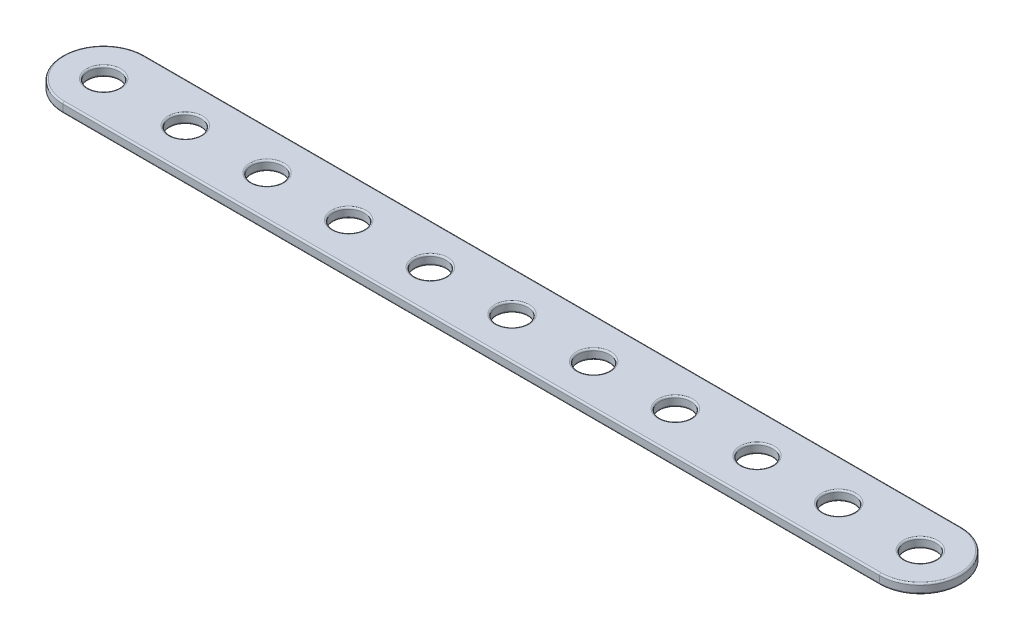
ISO-10303-21;
HEADER;
FILE_DESCRIPTION(('STEP AP214'),'2;1');
FILE_NAME('part.step','',(''),(''),'','','');
FILE_SCHEMA(('AUTOMOTIVE_DESIGN { 1 0 10303 214 1 1 1 1 }'));
ENDSEC;
DATA;
#1=APPLICATION_CONTEXT('core data for automotive mechanical design processes');
#2=APPLICATION_PROTOCOL_DEFINITION('international standard','automotive_design',2000,#1);
#3=PRODUCT_CONTEXT('',#1,'mechanical');
#4=PRODUCT('Part','Part','',(#3));
#5=PRODUCT_RELATED_PRODUCT_CATEGORY('part','',(#4));
#6=PRODUCT_DEFINITION_FORMATION('','',#4);
#7=PRODUCT_DEFINITION_CONTEXT('part definition',#1,'design');
#8=PRODUCT_DEFINITION('design','',#6,#7);
#9=PRODUCT_DEFINITION_SHAPE('','',#8);
#10=(LENGTH_UNIT() NAMED_UNIT(*) SI_UNIT(.MILLI.,.METRE.));
#11=(NAMED_UNIT(*) PLANE_ANGLE_UNIT() SI_UNIT($,.RADIAN.));
#12=(NAMED_UNIT(*) SI_UNIT($,.STERADIAN.) SOLID_ANGLE_UNIT());
#13=UNCERTAINTY_MEASURE_WITH_UNIT(LENGTH_MEASURE(1.E-05),#10,'distance_accuracy_value','');
#14=(GEOMETRIC_REPRESENTATION_CONTEXT(3) GLOBAL_UNCERTAINTY_ASSIGNED_CONTEXT((#13)) GLOBAL_UNIT_ASSIGNED_CONTEXT((#10,
#11,#12)) REPRESENTATION_CONTEXT('',''));
#15=CARTESIAN_POINT('',(0.,0.,0.));
#16=DIRECTION('',(0.,0.,1.));
#17=DIRECTION('',(1.,0.,0.));
#18=AXIS2_PLACEMENT_3D('',#15,#16,#17);
#19=CARTESIAN_POINT('',(0.,1.524,-6.35));
#20=DIRECTION('',(0.,-1.,0.));
#21=DIRECTION('',(0.,0.,-1.));
#22=AXIS2_PLACEMENT_3D('',#19,#20,#21);
#23=CYLINDRICAL_SURFACE('',#22,6.35);
#24=DIRECTION('',(0.,-1.,0.));
#25=VECTOR('',#24,1.);
#26=CARTESIAN_POINT('',(0.,1.524,-12.7));
#27=LINE('',#26,#25);
#28=CARTESIAN_POINT('',(0.,1.27,-12.7));
#29=VERTEX_POINT('',#28);
#30=CARTESIAN_POINT('',(0.,0.254000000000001,-12.7));
#31=VERTEX_POINT('',#30);
#32=EDGE_CURVE('E146',#29,#31,#27,.T.);
#33=ORIENTED_EDGE('',*,*,#32,.T.);
#34=CARTESIAN_POINT('',(0.,0.254,-6.35));
#35=DIRECTION('',(0.,1.,0.));
#36=DIRECTION('',(0.,0.,1.));
#37=AXIS2_PLACEMENT_3D('',#34,#35,#36);
#38=CIRCLE('',#37,6.35);
#39=CARTESIAN_POINT('',(0.,0.254000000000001,0.));
#40=VERTEX_POINT('',#39);
#41=EDGE_CURVE('E202',#31,#40,#38,.T.);
#42=ORIENTED_EDGE('',*,*,#41,.T.);
#43=DIRECTION('',(0.,-1.,0.));
#44=VECTOR('',#43,1.);
#45=CARTESIAN_POINT('',(0.,1.524,0.));
#46=LINE('',#45,#44);
#47=CARTESIAN_POINT('',(0.,1.27,0.));
#48=VERTEX_POINT('',#47);
#49=EDGE_CURVE('E120',#48,#40,#46,.T.);
#50=ORIENTED_EDGE('',*,*,#49,.F.);
#51=CARTESIAN_POINT('',(0.,1.27,-6.35));
#52=DIRECTION('',(0.,1.,0.));
#53=DIRECTION('',(0.,0.,1.));
#54=AXIS2_PLACEMENT_3D('',#51,#52,#53);
#55=CIRCLE('',#54,6.35);
#56=EDGE_CURVE('E200',#48,#29,#55,.F.);
#57=ORIENTED_EDGE('',*,*,#56,.T.);
#58=EDGE_LOOP('',(#33,#42,#50,#57));
#59=FACE_BOUND('',#58,.T.);
#60=ADVANCED_FACE('F36',(#59),#23,.T.);
#61=CARTESIAN_POINT('',(0.,1.524,0.));
#62=DIRECTION('',(0.,0.,-1.));
#63=DIRECTION('',(-1.,0.,0.));
#64=AXIS2_PLACEMENT_3D('',#61,#62,#63);
#65=PLANE('',#64);
#66=ORIENTED_EDGE('',*,*,#49,.T.);
#67=DIRECTION('',(1.,0.,0.));
#68=VECTOR('',#67,1.);
#69=CARTESIAN_POINT('',(0.,0.254,0.));
#70=LINE('',#69,#68);
#71=CARTESIAN_POINT('',(127.,0.254000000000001,0.));
#72=VERTEX_POINT('',#71);
#73=EDGE_CURVE('E119',#40,#72,#70,.T.);
#74=ORIENTED_EDGE('',*,*,#73,.T.);
#75=DIRECTION('',(0.,-1.,0.));
#76=VECTOR('',#75,1.);
#77=CARTESIAN_POINT('',(127.,1.524,0.));
#78=LINE('',#77,#76);
#79=CARTESIAN_POINT('',(127.,1.27,0.));
#80=VERTEX_POINT('',#79);
#81=EDGE_CURVE('E102',#80,#72,#78,.T.);
#82=ORIENTED_EDGE('',*,*,#81,.F.);
#83=DIRECTION('',(1.,0.,0.));
#84=VECTOR('',#83,1.);
#85=CARTESIAN_POINT('',(0.,1.27,0.));
#86=LINE('',#85,#84);
#87=EDGE_CURVE('E116',#80,#48,#86,.F.);
#88=ORIENTED_EDGE('',*,*,#87,.T.);
#89=EDGE_LOOP('',(#66,#74,#82,#88));
#90=FACE_BOUND('',#89,.T.);
#91=ADVANCED_FACE('F115',(#90),#65,.F.);
#92=CARTESIAN_POINT('',(127.,1.524,-6.35));
#93=DIRECTION('',(0.,-1.,0.));
#94=DIRECTION('',(0.,0.,-1.));
#95=AXIS2_PLACEMENT_3D('',#92,#93,#94);
#96=CYLINDRICAL_SURFACE('',#95,6.35);
#97=ORIENTED_EDGE('',*,*,#81,.T.);
#98=CARTESIAN_POINT('',(127.,0.254,-6.35));
#99=DIRECTION('',(0.,1.,0.));
#100=DIRECTION('',(0.,0.,1.));
#101=AXIS2_PLACEMENT_3D('',#98,#99,#100);
#102=CIRCLE('',#101,6.35);
#103=CARTESIAN_POINT('',(127.,0.254000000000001,-12.7));
#104=VERTEX_POINT('',#103);
#105=EDGE_CURVE('E108',#72,#104,#102,.T.);
#106=ORIENTED_EDGE('',*,*,#105,.T.);
#107=DIRECTION('',(0.,-1.,0.));
#108=VECTOR('',#107,1.);
#109=CARTESIAN_POINT('',(127.,1.524,-12.7));
#110=LINE('',#109,#108);
#111=CARTESIAN_POINT('',(127.,1.27,-12.7));
#112=VERTEX_POINT('',#111);
#113=EDGE_CURVE('E104',#112,#104,#110,.T.);
#114=ORIENTED_EDGE('',*,*,#113,.F.);
#115=CARTESIAN_POINT('',(127.,1.27,-6.35));
#116=DIRECTION('',(0.,1.,0.));
#117=DIRECTION('',(0.,0.,1.));
#118=AXIS2_PLACEMENT_3D('',#115,#116,#117);
#119=CIRCLE('',#118,6.35);
#120=EDGE_CURVE('E99',#112,#80,#119,.F.);
#121=ORIENTED_EDGE('',*,*,#120,.T.);
#122=EDGE_LOOP('',(#97,#106,#114,#121));
#123=FACE_BOUND('',#122,.T.);
#124=ADVANCED_FACE('F101',(#123),#96,.T.);
#125=CARTESIAN_POINT('',(0.,1.524,-12.7));
#126=DIRECTION('',(0.,0.,1.));
#127=DIRECTION('',(1.,0.,0.));
#128=AXIS2_PLACEMENT_3D('',#125,#126,#127);
#129=PLANE('',#128);
#130=ORIENTED_EDGE('',*,*,#113,.T.);
#131=DIRECTION('',(-1.,0.,0.));
#132=VECTOR('',#131,1.);
#133=CARTESIAN_POINT('',(0.,0.254,-12.7));
#134=LINE('',#133,#132);
#135=EDGE_CURVE('E198',#104,#31,#134,.T.);
#136=ORIENTED_EDGE('',*,*,#135,.T.);
#137=ORIENTED_EDGE('',*,*,#32,.F.);
#138=DIRECTION('',(-1.,0.,0.));
#139=VECTOR('',#138,1.);
#140=CARTESIAN_POINT('',(127.,1.27,-12.7));
#141=LINE('',#140,#139);
#142=EDGE_CURVE('E196',#29,#112,#141,.F.);
#143=ORIENTED_EDGE('',*,*,#142,.T.);
#144=EDGE_LOOP('',(#130,#136,#137,#143));
#145=FACE_BOUND('',#144,.T.);
#146=ADVANCED_FACE('F326',(#145),#129,.F.);
#147=CARTESIAN_POINT('',(0.,1.524,-6.35));
#148=DIRECTION('',(0.,1.,0.));
#149=DIRECTION('',(0.,0.,1.));
#150=AXIS2_PLACEMENT_3D('',#147,#148,#149);
#151=PLANE('',#150);
#152=CARTESIAN_POINT('',(127.,1.524,-6.35));
#153=DIRECTION('',(0.,1.,0.));
#154=DIRECTION('',(0.,0.,1.));
#155=AXIS2_PLACEMENT_3D('',#152,#153,#154);
#156=CIRCLE('',#155,6.096);
#157=CARTESIAN_POINT('',(127.,1.524,-0.254));
#158=VERTEX_POINT('',#157);
#159=CARTESIAN_POINT('',(127.,1.524,-12.446));
#160=VERTEX_POINT('',#159);
#161=EDGE_CURVE('E43',#158,#160,#156,.T.);
#162=ORIENTED_EDGE('',*,*,#161,.T.);
#163=DIRECTION('',(-1.,0.,0.));
#164=VECTOR('',#163,1.);
#165=CARTESIAN_POINT('',(0.,1.524,-12.446));
#166=LINE('',#165,#164);
#167=CARTESIAN_POINT('',(0.,1.524,-12.446));
#168=VERTEX_POINT('',#167);
#169=EDGE_CURVE('E11',#160,#168,#166,.T.);
#170=ORIENTED_EDGE('',*,*,#169,.T.);
#171=CARTESIAN_POINT('',(0.,1.524,-6.35));
#172=DIRECTION('',(0.,1.,0.));
#173=DIRECTION('',(0.,0.,1.));
#174=AXIS2_PLACEMENT_3D('',#171,#172,#173);
#175=CIRCLE('',#174,6.096);
#176=CARTESIAN_POINT('',(0.,1.524,-0.254));
#177=VERTEX_POINT('',#176);
#178=EDGE_CURVE('E311',#168,#177,#175,.T.);
#179=ORIENTED_EDGE('',*,*,#178,.T.);
#180=DIRECTION('',(1.,0.,0.));
#181=VECTOR('',#180,1.);
#182=CARTESIAN_POINT('',(127.,1.524,-0.254));
#183=LINE('',#182,#181);
#184=EDGE_CURVE('E53',#177,#158,#183,.T.);
#185=ORIENTED_EDGE('',*,*,#184,.T.);
#186=EDGE_LOOP('',(#162,#170,#179,#185));
#187=FACE_BOUND('',#186,.T.);
#188=CARTESIAN_POINT('',(0.,1.524,-6.35));
#189=DIRECTION('',(0.,1.,0.));
#190=DIRECTION('',(0.,0.,1.));
#191=AXIS2_PLACEMENT_3D('',#188,#189,#190);
#192=CIRCLE('',#191,2.667);
#193=CARTESIAN_POINT('',(0.,1.524,-3.683));
#194=VERTEX_POINT('',#193);
#195=EDGE_CURVE('E307',#194,#194,#192,.F.);
#196=ORIENTED_EDGE('',*,*,#195,.T.);
#197=EDGE_LOOP('',(#196));
#198=FACE_BOUND('',#197,.T.);
#199=CARTESIAN_POINT('',(12.7,1.524,-6.35));
#200=DIRECTION('',(0.,1.,0.));
#201=DIRECTION('',(0.,0.,1.));
#202=AXIS2_PLACEMENT_3D('',#199,#200,#201);
#203=CIRCLE('',#202,2.667);
#204=CARTESIAN_POINT('',(12.7,1.524,-3.683));
#205=VERTEX_POINT('',#204);
#206=EDGE_CURVE('E304',#205,#205,#203,.F.);
#207=ORIENTED_EDGE('',*,*,#206,.T.);
#208=EDGE_LOOP('',(#207));
#209=FACE_BOUND('',#208,.T.);
#210=CARTESIAN_POINT('',(25.4,1.524,-6.35));
#211=DIRECTION('',(0.,1.,0.));
#212=DIRECTION('',(0.,0.,1.));
#213=AXIS2_PLACEMENT_3D('',#210,#211,#212);
#214=CIRCLE('',#213,2.667);
#215=CARTESIAN_POINT('',(25.4,1.524,-3.683));
#216=VERTEX_POINT('',#215);
#217=EDGE_CURVE('E301',#216,#216,#214,.F.);
#218=ORIENTED_EDGE('',*,*,#217,.T.);
#219=EDGE_LOOP('',(#218));
#220=FACE_BOUND('',#219,.T.);
#221=CARTESIAN_POINT('',(38.1,1.524,-6.35));
#222=DIRECTION('',(0.,1.,0.));
#223=DIRECTION('',(0.,0.,1.));
#224=AXIS2_PLACEMENT_3D('',#221,#222,#223);
#225=CIRCLE('',#224,2.667);
#226=CARTESIAN_POINT('',(38.1,1.524,-3.683));
#227=VERTEX_POINT('',#226);
#228=EDGE_CURVE('E298',#227,#227,#225,.F.);
#229=ORIENTED_EDGE('',*,*,#228,.T.);
#230=EDGE_LOOP('',(#229));
#231=FACE_BOUND('',#230,.T.);
#232=CARTESIAN_POINT('',(50.8,1.524,-6.35));
#233=DIRECTION('',(0.,1.,0.));
#234=DIRECTION('',(0.,0.,1.));
#235=AXIS2_PLACEMENT_3D('',#232,#233,#234);
#236=CIRCLE('',#235,2.667);
#237=CARTESIAN_POINT('',(50.8,1.524,-3.683));
#238=VERTEX_POINT('',#237);
#239=EDGE_CURVE('E295',#238,#238,#236,.F.);
#240=ORIENTED_EDGE('',*,*,#239,.T.);
#241=EDGE_LOOP('',(#240));
#242=FACE_BOUND('',#241,.T.);
#243=CARTESIAN_POINT('',(63.5,1.524,-6.35));
#244=DIRECTION('',(0.,1.,0.));
#245=DIRECTION('',(0.,0.,1.));
#246=AXIS2_PLACEMENT_3D('',#243,#244,#245);
#247=CIRCLE('',#246,2.667);
#248=CARTESIAN_POINT('',(63.5,1.524,-3.683));
#249=VERTEX_POINT('',#248);
#250=EDGE_CURVE('E292',#249,#249,#247,.F.);
#251=ORIENTED_EDGE('',*,*,#250,.T.);
#252=EDGE_LOOP('',(#251));
#253=FACE_BOUND('',#252,.T.);
#254=CARTESIAN_POINT('',(76.2,1.524,-6.35));
#255=DIRECTION('',(0.,1.,0.));
#256=DIRECTION('',(0.,0.,1.));
#257=AXIS2_PLACEMENT_3D('',#254,#255,#256);
#258=CIRCLE('',#257,2.667);
#259=CARTESIAN_POINT('',(76.2,1.524,-3.683));
#260=VERTEX_POINT('',#259);
#261=EDGE_CURVE('E289',#260,#260,#258,.F.);
#262=ORIENTED_EDGE('',*,*,#261,.T.);
#263=EDGE_LOOP('',(#262));
#264=FACE_BOUND('',#263,.T.);
#265=CARTESIAN_POINT('',(88.9,1.524,-6.35));
#266=DIRECTION('',(0.,1.,0.));
#267=DIRECTION('',(0.,0.,1.));
#268=AXIS2_PLACEMENT_3D('',#265,#266,#267);
#269=CIRCLE('',#268,2.667);
#270=CARTESIAN_POINT('',(88.9,1.524,-3.683));
#271=VERTEX_POINT('',#270);
#272=EDGE_CURVE('E286',#271,#271,#269,.F.);
#273=ORIENTED_EDGE('',*,*,#272,.T.);
#274=EDGE_LOOP('',(#273));
#275=FACE_BOUND('',#274,.T.);
#276=CARTESIAN_POINT('',(101.6,1.524,-6.35));
#277=DIRECTION('',(0.,1.,0.));
#278=DIRECTION('',(0.,0.,1.));
#279=AXIS2_PLACEMENT_3D('',#276,#277,#278);
#280=CIRCLE('',#279,2.667);
#281=CARTESIAN_POINT('',(101.6,1.524,-3.683));
#282=VERTEX_POINT('',#281);
#283=EDGE_CURVE('E283',#282,#282,#280,.F.);
#284=ORIENTED_EDGE('',*,*,#283,.T.);
#285=EDGE_LOOP('',(#284));
#286=FACE_BOUND('',#285,.T.);
#287=CARTESIAN_POINT('',(114.3,1.524,-6.35));
#288=DIRECTION('',(0.,1.,0.));
#289=DIRECTION('',(0.,0.,1.));
#290=AXIS2_PLACEMENT_3D('',#287,#288,#289);
#291=CIRCLE('',#290,2.667);
#292=CARTESIAN_POINT('',(114.3,1.524,-3.683));
#293=VERTEX_POINT('',#292);
#294=EDGE_CURVE('E280',#293,#293,#291,.F.);
#295=ORIENTED_EDGE('',*,*,#294,.T.);
#296=EDGE_LOOP('',(#295));
#297=FACE_BOUND('',#296,.T.);
#298=CARTESIAN_POINT('',(127.,1.524,-6.35));
#299=DIRECTION('',(0.,1.,0.));
#300=DIRECTION('',(0.,0.,1.));
#301=AXIS2_PLACEMENT_3D('',#298,#299,#300);
#302=CIRCLE('',#301,2.667);
#303=CARTESIAN_POINT('',(127.,1.524,-3.683));
#304=VERTEX_POINT('',#303);
#305=EDGE_CURVE('E276',#304,#304,#302,.F.);
#306=ORIENTED_EDGE('',*,*,#305,.T.);
#307=EDGE_LOOP('',(#306));
#308=FACE_BOUND('',#307,.T.);
#309=ADVANCED_FACE('F314',(#187,#198,#209,#220,#231,#242,#253,#264,#275,#286,#297,#308),#151,.T.);
#310=CARTESIAN_POINT('',(0.,0.,-6.35));
#311=DIRECTION('',(0.,1.,0.));
#312=DIRECTION('',(0.,0.,1.));
#313=AXIS2_PLACEMENT_3D('',#310,#311,#312);
#314=PLANE('',#313);
#315=CARTESIAN_POINT('',(127.,0.,-6.35));
#316=DIRECTION('',(0.,1.,0.));
#317=DIRECTION('',(0.,0.,1.));
#318=AXIS2_PLACEMENT_3D('',#315,#316,#317);
#319=CIRCLE('',#318,6.096);
#320=CARTESIAN_POINT('',(127.,0.,-12.446));
#321=VERTEX_POINT('',#320);
#322=CARTESIAN_POINT('',(127.,0.,-0.254));
#323=VERTEX_POINT('',#322);
#324=EDGE_CURVE('E191',#321,#323,#319,.F.);
#325=ORIENTED_EDGE('',*,*,#324,.T.);
#326=DIRECTION('',(1.,0.,0.));
#327=VECTOR('',#326,1.);
#328=CARTESIAN_POINT('',(0.,0.,-0.254));
#329=LINE('',#328,#327);
#330=CARTESIAN_POINT('',(0.,0.,-0.254));
#331=VERTEX_POINT('',#330);
#332=EDGE_CURVE('E109',#323,#331,#329,.F.);
#333=ORIENTED_EDGE('',*,*,#332,.T.);
#334=CARTESIAN_POINT('',(0.,0.,-6.35));
#335=DIRECTION('',(0.,1.,0.));
#336=DIRECTION('',(0.,0.,1.));
#337=AXIS2_PLACEMENT_3D('',#334,#335,#336);
#338=CIRCLE('',#337,6.096);
#339=CARTESIAN_POINT('',(0.,0.,-12.446));
#340=VERTEX_POINT('',#339);
#341=EDGE_CURVE('E187',#331,#340,#338,.F.);
#342=ORIENTED_EDGE('',*,*,#341,.T.);
#343=DIRECTION('',(-1.,0.,0.));
#344=VECTOR('',#343,1.);
#345=CARTESIAN_POINT('',(0.,0.,-12.446));
#346=LINE('',#345,#344);
#347=EDGE_CURVE('E189',#340,#321,#346,.F.);
#348=ORIENTED_EDGE('',*,*,#347,.T.);
#349=EDGE_LOOP('',(#325,#333,#342,#348));
#350=FACE_BOUND('',#349,.T.);
#351=CARTESIAN_POINT('',(0.,0.,-6.35));
#352=DIRECTION('',(0.,1.,0.));
#353=DIRECTION('',(0.,0.,1.));
#354=AXIS2_PLACEMENT_3D('',#351,#352,#353);
#355=CIRCLE('',#354,2.667);
#356=CARTESIAN_POINT('',(0.,0.,-3.683));
#357=VERTEX_POINT('',#356);
#358=EDGE_CURVE('E184',#357,#357,#355,.T.);
#359=ORIENTED_EDGE('',*,*,#358,.T.);
#360=EDGE_LOOP('',(#359));
#361=FACE_BOUND('',#360,.T.);
#362=CARTESIAN_POINT('',(12.7,0.,-6.35));
#363=DIRECTION('',(0.,1.,0.));
#364=DIRECTION('',(0.,0.,1.));
#365=AXIS2_PLACEMENT_3D('',#362,#363,#364);
#366=CIRCLE('',#365,2.667);
#367=CARTESIAN_POINT('',(12.7,0.,-3.683));
#368=VERTEX_POINT('',#367);
#369=EDGE_CURVE('E181',#368,#368,#366,.T.);
#370=ORIENTED_EDGE('',*,*,#369,.T.);
#371=EDGE_LOOP('',(#370));
#372=FACE_BOUND('',#371,.T.);
#373=CARTESIAN_POINT('',(25.4,0.,-6.35));
#374=DIRECTION('',(0.,1.,0.));
#375=DIRECTION('',(0.,0.,1.));
#376=AXIS2_PLACEMENT_3D('',#373,#374,#375);
#377=CIRCLE('',#376,2.667);
#378=CARTESIAN_POINT('',(25.4,0.,-3.683));
#379=VERTEX_POINT('',#378);
#380=EDGE_CURVE('E178',#379,#379,#377,.T.);
#381=ORIENTED_EDGE('',*,*,#380,.T.);
#382=EDGE_LOOP('',(#381));
#383=FACE_BOUND('',#382,.T.);
#384=CARTESIAN_POINT('',(38.1,0.,-6.35));
#385=DIRECTION('',(0.,1.,0.));
#386=DIRECTION('',(0.,0.,1.));
#387=AXIS2_PLACEMENT_3D('',#384,#385,#386);
#388=CIRCLE('',#387,2.667);
#389=CARTESIAN_POINT('',(38.1,0.,-3.683));
#390=VERTEX_POINT('',#389);
#391=EDGE_CURVE('E175',#390,#390,#388,.T.);
#392=ORIENTED_EDGE('',*,*,#391,.T.);
#393=EDGE_LOOP('',(#392));
#394=FACE_BOUND('',#393,.T.);
#395=CARTESIAN_POINT('',(50.8,0.,-6.35));
#396=DIRECTION('',(0.,1.,0.));
#397=DIRECTION('',(0.,0.,1.));
#398=AXIS2_PLACEMENT_3D('',#395,#396,#397);
#399=CIRCLE('',#398,2.667);
#400=CARTESIAN_POINT('',(50.8,0.,-3.683));
#401=VERTEX_POINT('',#400);
#402=EDGE_CURVE('E172',#401,#401,#399,.T.);
#403=ORIENTED_EDGE('',*,*,#402,.T.);
#404=EDGE_LOOP('',(#403));
#405=FACE_BOUND('',#404,.T.);
#406=CARTESIAN_POINT('',(63.5,0.,-6.35));
#407=DIRECTION('',(0.,1.,0.));
#408=DIRECTION('',(0.,0.,1.));
#409=AXIS2_PLACEMENT_3D('',#406,#407,#408);
#410=CIRCLE('',#409,2.667);
#411=CARTESIAN_POINT('',(63.5,0.,-3.683));
#412=VERTEX_POINT('',#411);
#413=EDGE_CURVE('E169',#412,#412,#410,.T.);
#414=ORIENTED_EDGE('',*,*,#413,.T.);
#415=EDGE_LOOP('',(#414));
#416=FACE_BOUND('',#415,.T.);
#417=CARTESIAN_POINT('',(76.2,0.,-6.35));
#418=DIRECTION('',(0.,1.,0.));
#419=DIRECTION('',(0.,0.,1.));
#420=AXIS2_PLACEMENT_3D('',#417,#418,#419);
#421=CIRCLE('',#420,2.667);
#422=CARTESIAN_POINT('',(76.2,0.,-3.683));
#423=VERTEX_POINT('',#422);
#424=EDGE_CURVE('E165',#423,#423,#421,.T.);
#425=ORIENTED_EDGE('',*,*,#424,.T.);
#426=EDGE_LOOP('',(#425));
#427=FACE_BOUND('',#426,.T.);
#428=CARTESIAN_POINT('',(88.9,0.,-6.35));
#429=DIRECTION('',(0.,1.,0.));
#430=DIRECTION('',(0.,0.,1.));
#431=AXIS2_PLACEMENT_3D('',#428,#429,#430);
#432=CIRCLE('',#431,2.667);
#433=CARTESIAN_POINT('',(88.9,0.,-3.683));
#434=VERTEX_POINT('',#433);
#435=EDGE_CURVE('E162',#434,#434,#432,.T.);
#436=ORIENTED_EDGE('',*,*,#435,.T.);
#437=EDGE_LOOP('',(#436));
#438=FACE_BOUND('',#437,.T.);
#439=CARTESIAN_POINT('',(101.6,0.,-6.35));
#440=DIRECTION('',(0.,1.,0.));
#441=DIRECTION('',(0.,0.,1.));
#442=AXIS2_PLACEMENT_3D('',#439,#440,#441);
#443=CIRCLE('',#442,2.667);
#444=CARTESIAN_POINT('',(101.6,0.,-3.683));
#445=VERTEX_POINT('',#444);
#446=EDGE_CURVE('E159',#445,#445,#443,.T.);
#447=ORIENTED_EDGE('',*,*,#446,.T.);
#448=EDGE_LOOP('',(#447));
#449=FACE_BOUND('',#448,.T.);
#450=CARTESIAN_POINT('',(114.3,0.,-6.35));
#451=DIRECTION('',(0.,1.,0.));
#452=DIRECTION('',(0.,0.,1.));
#453=AXIS2_PLACEMENT_3D('',#450,#451,#452);
#454=CIRCLE('',#453,2.667);
#455=CARTESIAN_POINT('',(114.3,0.,-3.683));
#456=VERTEX_POINT('',#455);
#457=EDGE_CURVE('E156',#456,#456,#454,.T.);
#458=ORIENTED_EDGE('',*,*,#457,.T.);
#459=EDGE_LOOP('',(#458));
#460=FACE_BOUND('',#459,.T.);
#461=CARTESIAN_POINT('',(127.,0.,-6.35));
#462=DIRECTION('',(0.,1.,0.));
#463=DIRECTION('',(0.,0.,1.));
#464=AXIS2_PLACEMENT_3D('',#461,#462,#463);
#465=CIRCLE('',#464,2.667);
#466=CARTESIAN_POINT('',(127.,0.,-3.683));
#467=VERTEX_POINT('',#466);
#468=EDGE_CURVE('E152',#467,#467,#465,.T.);
#469=ORIENTED_EDGE('',*,*,#468,.T.);
#470=EDGE_LOOP('',(#469));
#471=FACE_BOUND('',#470,.T.);
#472=ADVANCED_FACE('F355',(#350,#361,#372,#383,#394,#405,#416,#427,#438,#449,#460,#471),#314,.F.);
#473=CARTESIAN_POINT('',(0.,0.,-6.35));
#474=DIRECTION('',(0.,1.,0.));
#475=DIRECTION('',(0.,0.,1.));
#476=AXIS2_PLACEMENT_3D('',#473,#474,#475);
#477=CYLINDRICAL_SURFACE('',#476,2.413);
#478=CARTESIAN_POINT('',(0.,0.254,-6.35));
#479=DIRECTION('',(0.,1.,0.));
#480=DIRECTION('',(0.,0.,1.));
#481=AXIS2_PLACEMENT_3D('',#478,#479,#480);
#482=CIRCLE('',#481,2.413);
#483=CARTESIAN_POINT('',(0.,0.254,-3.937));
#484=VERTEX_POINT('',#483);
#485=EDGE_CURVE('E208',#484,#484,#482,.F.);
#486=CARTESIAN_POINT('',(0.,1.27,-6.35));
#487=DIRECTION('',(0.,1.,0.));
#488=DIRECTION('',(0.,0.,1.));
#489=AXIS2_PLACEMENT_3D('',#486,#487,#488);
#490=CIRCLE('',#489,2.413);
#491=CARTESIAN_POINT('',(0.,1.27,-3.937));
#492=VERTEX_POINT('',#491);
#493=EDGE_CURVE('E204',#492,#492,#490,.T.);
#494=CARTESIAN_POINT('',(0.,0.254,-3.937));
#495=CARTESIAN_POINT('',(0.,0.264583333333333,-3.937));
#496=CARTESIAN_POINT('',(0.,0.275166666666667,-3.937));
#497=CARTESIAN_POINT('',(0.,0.296333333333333,-3.937));
#498=CARTESIAN_POINT('',(0.,0.306916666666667,-3.937));
#499=CARTESIAN_POINT('',(0.,0.328083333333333,-3.937));
#500=CARTESIAN_POINT('',(0.,0.338666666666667,-3.937));
#501=CARTESIAN_POINT('',(0.,0.359833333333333,-3.937));
#502=CARTESIAN_POINT('',(0.,0.370416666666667,-3.937));
#503=CARTESIAN_POINT('',(0.,0.391583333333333,-3.937));
#504=CARTESIAN_POINT('',(0.,0.402166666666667,-3.937));
#505=CARTESIAN_POINT('',(0.,0.423333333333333,-3.937));
#506=CARTESIAN_POINT('',(0.,0.433916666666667,-3.937));
#507=CARTESIAN_POINT('',(0.,0.455083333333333,-3.937));
#508=CARTESIAN_POINT('',(0.,0.465666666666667,-3.937));
#509=CARTESIAN_POINT('',(0.,0.486833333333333,-3.937));
#510=CARTESIAN_POINT('',(0.,0.497416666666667,-3.937));
#511=CARTESIAN_POINT('',(0.,0.518583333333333,-3.937));
#512=CARTESIAN_POINT('',(0.,0.529166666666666,-3.937));
#513=CARTESIAN_POINT('',(0.,0.550333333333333,-3.937));
#514=CARTESIAN_POINT('',(0.,0.560916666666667,-3.937));
#515=CARTESIAN_POINT('',(0.,0.582083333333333,-3.937));
#516=CARTESIAN_POINT('',(0.,0.592666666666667,-3.937));
#517=CARTESIAN_POINT('',(0.,0.613833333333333,-3.937));
#518=CARTESIAN_POINT('',(0.,0.624416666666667,-3.937));
#519=CARTESIAN_POINT('',(0.,0.645583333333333,-3.937));
#520=CARTESIAN_POINT('',(0.,0.656166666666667,-3.937));
#521=CARTESIAN_POINT('',(0.,0.677333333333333,-3.937));
#522=CARTESIAN_POINT('',(0.,0.687916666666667,-3.937));
#523=CARTESIAN_POINT('',(0.,0.709083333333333,-3.937));
#524=CARTESIAN_POINT('',(0.,0.719666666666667,-3.937));
#525=CARTESIAN_POINT('',(0.,0.740833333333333,-3.937));
#526=CARTESIAN_POINT('',(0.,0.751416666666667,-3.937));
#527=CARTESIAN_POINT('',(0.,0.772583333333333,-3.937));
#528=CARTESIAN_POINT('',(0.,0.783166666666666,-3.937));
#529=CARTESIAN_POINT('',(0.,0.804333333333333,-3.937));
#530=CARTESIAN_POINT('',(0.,0.814916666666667,-3.937));
#531=CARTESIAN_POINT('',(0.,0.836083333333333,-3.937));
#532=CARTESIAN_POINT('',(0.,0.846666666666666,-3.937));
#533=CARTESIAN_POINT('',(0.,0.867833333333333,-3.937));
#534=CARTESIAN_POINT('',(0.,0.878416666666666,-3.937));
#535=CARTESIAN_POINT('',(0.,0.899583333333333,-3.937));
#536=CARTESIAN_POINT('',(0.,0.910166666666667,-3.937));
#537=CARTESIAN_POINT('',(0.,0.931333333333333,-3.937));
#538=CARTESIAN_POINT('',(0.,0.941916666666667,-3.937));
#539=CARTESIAN_POINT('',(0.,0.963083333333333,-3.937));
#540=CARTESIAN_POINT('',(0.,0.973666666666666,-3.937));
#541=CARTESIAN_POINT('',(0.,0.994833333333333,-3.937));
#542=CARTESIAN_POINT('',(0.,1.00541666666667,-3.937));
#543=CARTESIAN_POINT('',(0.,1.02658333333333,-3.937));
#544=CARTESIAN_POINT('',(0.,1.03716666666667,-3.937));
#545=CARTESIAN_POINT('',(0.,1.05833333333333,-3.937));
#546=CARTESIAN_POINT('',(0.,1.06891666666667,-3.937));
#547=CARTESIAN_POINT('',(0.,1.09008333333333,-3.937));
#548=CARTESIAN_POINT('',(0.,1.10066666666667,-3.937));
#549=CARTESIAN_POINT('',(0.,1.12183333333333,-3.937));
#550=CARTESIAN_POINT('',(0.,1.13241666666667,-3.937));
#551=CARTESIAN_POINT('',(0.,1.15358333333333,-3.937));
#552=CARTESIAN_POINT('',(0.,1.16416666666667,-3.937));
#553=CARTESIAN_POINT('',(0.,1.18533333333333,-3.937));
#554=CARTESIAN_POINT('',(0.,1.19591666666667,-3.937));
#555=CARTESIAN_POINT('',(0.,1.21708333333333,-3.937));
#556=CARTESIAN_POINT('',(0.,1.22766666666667,-3.937));
#557=CARTESIAN_POINT('',(0.,1.24883333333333,-3.937));
#558=CARTESIAN_POINT('',(0.,1.25941666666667,-3.937));
#559=CARTESIAN_POINT('',(0.,1.27,-3.937));
#560=B_SPLINE_CURVE_WITH_KNOTS('',3,(#494,#495,#496,#497,#498,#499,#500,#501,#502,#503,#504,
#505,#506,#507,#508,#509,#510,#511,#512,#513,#514,#515,#516,#517,#518,#519,#520,#521,#522,#523,
#524,#525,#526,#527,#528,#529,#530,#531,#532,#533,#534,#535,#536,#537,#538,#539,#540,#541,#542,
#543,#544,#545,#546,#547,#548,#549,#550,#551,#552,#553,#554,#555,#556,#557,#558,#559),
.UNSPECIFIED.,.F.,.F.,(4,2,2,2,2,2,2,2,2,2,2,2,2,2,2,2,2,2,2,2,2,2,2,2,2,2,2,2,2,2,2,2,4),(0.,
0.03175,0.0635,0.09525,0.127,0.15875,0.1905,0.22225,0.254,0.28575,0.3175,0.34925,0.381,0.41275,
0.4445,0.47625,0.508,0.53975,0.5715,0.60325,0.635,0.66675,0.6985,0.73025,0.762,0.79375,0.8255,
0.85725,0.889,0.92075,0.9525,0.98425,1.016),.UNSPECIFIED.);
#561=EDGE_CURVE('BSEAM358',#484,#492,#560,.T.);
#562=ORIENTED_EDGE('',*,*,#485,.T.);
#563=ORIENTED_EDGE('',*,*,#493,.T.);
#564=ORIENTED_EDGE('',*,*,#561,.T.);
#565=ORIENTED_EDGE('',*,*,#561,.F.);
#566=EDGE_LOOP('',(#562,#564,#563,#565));
#567=FACE_BOUND('',#566,.T.);
#568=ADVANCED_FACE('F358',(#567),#477,.F.);
#569=CARTESIAN_POINT('',(12.7,0.,-6.35));
#570=DIRECTION('',(0.,1.,0.));
#571=DIRECTION('',(0.,0.,1.));
#572=AXIS2_PLACEMENT_3D('',#569,#570,#571);
#573=CYLINDRICAL_SURFACE('',#572,2.413);
#574=CARTESIAN_POINT('',(12.7,0.254,-6.35));
#575=DIRECTION('',(0.,1.,0.));
#576=DIRECTION('',(0.,0.,1.));
#577=AXIS2_PLACEMENT_3D('',#574,#575,#576);
#578=CIRCLE('',#577,2.413);
#579=CARTESIAN_POINT('',(12.7,0.254,-3.937));
#580=VERTEX_POINT('',#579);
#581=EDGE_CURVE('E215',#580,#580,#578,.F.);
#582=CARTESIAN_POINT('',(12.7,1.27,-6.35));
#583=DIRECTION('',(0.,1.,0.));
#584=DIRECTION('',(0.,0.,1.));
#585=AXIS2_PLACEMENT_3D('',#582,#583,#584);
#586=CIRCLE('',#585,2.413);
#587=CARTESIAN_POINT('',(12.7,1.27,-3.937));
#588=VERTEX_POINT('',#587);
#589=EDGE_CURVE('E212',#588,#588,#586,.T.);
#590=CARTESIAN_POINT('',(12.7,0.254,-3.937));
#591=CARTESIAN_POINT('',(12.7,0.264583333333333,-3.937));
#592=CARTESIAN_POINT('',(12.7,0.275166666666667,-3.937));
#593=CARTESIAN_POINT('',(12.7,0.296333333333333,-3.937));
#594=CARTESIAN_POINT('',(12.7,0.306916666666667,-3.937));
#595=CARTESIAN_POINT('',(12.7,0.328083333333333,-3.937));
#596=CARTESIAN_POINT('',(12.7,0.338666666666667,-3.937));
#597=CARTESIAN_POINT('',(12.7,0.359833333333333,-3.937));
#598=CARTESIAN_POINT('',(12.7,0.370416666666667,-3.937));
#599=CARTESIAN_POINT('',(12.7,0.391583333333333,-3.937));
#600=CARTESIAN_POINT('',(12.7,0.402166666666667,-3.937));
#601=CARTESIAN_POINT('',(12.7,0.423333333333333,-3.937));
#602=CARTESIAN_POINT('',(12.7,0.433916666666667,-3.937));
#603=CARTESIAN_POINT('',(12.7,0.455083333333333,-3.937));
#604=CARTESIAN_POINT('',(12.7,0.465666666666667,-3.937));
#605=CARTESIAN_POINT('',(12.7,0.486833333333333,-3.937));
#606=CARTESIAN_POINT('',(12.7,0.497416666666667,-3.937));
#607=CARTESIAN_POINT('',(12.7,0.518583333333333,-3.937));
#608=CARTESIAN_POINT('',(12.7,0.529166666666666,-3.937));
#609=CARTESIAN_POINT('',(12.7,0.550333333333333,-3.937));
#610=CARTESIAN_POINT('',(12.7,0.560916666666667,-3.937));
#611=CARTESIAN_POINT('',(12.7,0.582083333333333,-3.937));
#612=CARTESIAN_POINT('',(12.7,0.592666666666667,-3.937));
#613=CARTESIAN_POINT('',(12.7,0.613833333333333,-3.937));
#614=CARTESIAN_POINT('',(12.7,0.624416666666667,-3.937));
#615=CARTESIAN_POINT('',(12.7,0.645583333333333,-3.937));
#616=CARTESIAN_POINT('',(12.7,0.656166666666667,-3.937));
#617=CARTESIAN_POINT('',(12.7,0.677333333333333,-3.937));
#618=CARTESIAN_POINT('',(12.7,0.687916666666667,-3.937));
#619=CARTESIAN_POINT('',(12.7,0.709083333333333,-3.937));
#620=CARTESIAN_POINT('',(12.7,0.719666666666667,-3.937));
#621=CARTESIAN_POINT('',(12.7,0.740833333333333,-3.937));
#622=CARTESIAN_POINT('',(12.7,0.751416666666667,-3.937));
#623=CARTESIAN_POINT('',(12.7,0.772583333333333,-3.937));
#624=CARTESIAN_POINT('',(12.7,0.783166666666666,-3.937));
#625=CARTESIAN_POINT('',(12.7,0.804333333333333,-3.937));
#626=CARTESIAN_POINT('',(12.7,0.814916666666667,-3.937));
#627=CARTESIAN_POINT('',(12.7,0.836083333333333,-3.937));
#628=CARTESIAN_POINT('',(12.7,0.846666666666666,-3.937));
#629=CARTESIAN_POINT('',(12.7,0.867833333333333,-3.937));
#630=CARTESIAN_POINT('',(12.7,0.878416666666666,-3.937));
#631=CARTESIAN_POINT('',(12.7,0.899583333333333,-3.937));
#632=CARTESIAN_POINT('',(12.7,0.910166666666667,-3.937));
#633=CARTESIAN_POINT('',(12.7,0.931333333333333,-3.937));
#634=CARTESIAN_POINT('',(12.7,0.941916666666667,-3.937));
#635=CARTESIAN_POINT('',(12.7,0.963083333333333,-3.937));
#636=CARTESIAN_POINT('',(12.7,0.973666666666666,-3.937));
#637=CARTESIAN_POINT('',(12.7,0.994833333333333,-3.937));
#638=CARTESIAN_POINT('',(12.7,1.00541666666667,-3.937));
#639=CARTESIAN_POINT('',(12.7,1.02658333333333,-3.937));
#640=CARTESIAN_POINT('',(12.7,1.03716666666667,-3.937));
#641=CARTESIAN_POINT('',(12.7,1.05833333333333,-3.937));
#642=CARTESIAN_POINT('',(12.7,1.06891666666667,-3.937));
#643=CARTESIAN_POINT('',(12.7,1.09008333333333,-3.937));
#644=CARTESIAN_POINT('',(12.7,1.10066666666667,-3.937));
#645=CARTESIAN_POINT('',(12.7,1.12183333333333,-3.937));
#646=CARTESIAN_POINT('',(12.7,1.13241666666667,-3.937));
#647=CARTESIAN_POINT('',(12.7,1.15358333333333,-3.937));
#648=CARTESIAN_POINT('',(12.7,1.16416666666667,-3.937));
#649=CARTESIAN_POINT('',(12.7,1.18533333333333,-3.937));
#650=CARTESIAN_POINT('',(12.7,1.19591666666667,-3.937));
#651=CARTESIAN_POINT('',(12.7,1.21708333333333,-3.937));
#652=CARTESIAN_POINT('',(12.7,1.22766666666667,-3.937));
#653=CARTESIAN_POINT('',(12.7,1.24883333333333,-3.937));
#654=CARTESIAN_POINT('',(12.7,1.25941666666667,-3.937));
#655=CARTESIAN_POINT('',(12.7,1.27,-3.937));
#656=B_SPLINE_CURVE_WITH_KNOTS('',3,(#590,#591,#592,#593,#594,#595,#596,#597,#598,#599,#600,
#601,#602,#603,#604,#605,#606,#607,#608,#609,#610,#611,#612,#613,#614,#615,#616,#617,#618,#619,
#620,#621,#622,#623,#624,#625,#626,#627,#628,#629,#630,#631,#632,#633,#634,#635,#636,#637,#638,
#639,#640,#641,#642,#643,#644,#645,#646,#647,#648,#649,#650,#651,#652,#653,#654,#655),
.UNSPECIFIED.,.F.,.F.,(4,2,2,2,2,2,2,2,2,2,2,2,2,2,2,2,2,2,2,2,2,2,2,2,2,2,2,2,2,2,2,2,4),(0.,
0.03175,0.0635,0.09525,0.127,0.15875,0.1905,0.22225,0.254,0.28575,0.3175,0.34925,0.381,0.41275,
0.4445,0.47625,0.508,0.53975,0.5715,0.60325,0.635,0.66675,0.6985,0.73025,0.762,0.79375,0.8255,
0.85725,0.889,0.92075,0.9525,0.98425,1.016),.UNSPECIFIED.);
#657=EDGE_CURVE('BSEAM362',#580,#588,#656,.T.);
#658=ORIENTED_EDGE('',*,*,#581,.T.);
#659=ORIENTED_EDGE('',*,*,#589,.T.);
#660=ORIENTED_EDGE('',*,*,#657,.T.);
#661=ORIENTED_EDGE('',*,*,#657,.F.);
#662=EDGE_LOOP('',(#658,#660,#659,#661));
#663=FACE_BOUND('',#662,.T.);
#664=ADVANCED_FACE('F362',(#663),#573,.F.);
#665=CARTESIAN_POINT('',(25.4,0.,-6.35));
#666=DIRECTION('',(0.,1.,0.));
#667=DIRECTION('',(0.,0.,1.));
#668=AXIS2_PLACEMENT_3D('',#665,#666,#667);
#669=CYLINDRICAL_SURFACE('',#668,2.413);
#670=CARTESIAN_POINT('',(25.4,0.254,-6.35));
#671=DIRECTION('',(0.,1.,0.));
#672=DIRECTION('',(0.,0.,1.));
#673=AXIS2_PLACEMENT_3D('',#670,#671,#672);
#674=CIRCLE('',#673,2.413);
#675=CARTESIAN_POINT('',(25.4,0.254,-3.937));
#676=VERTEX_POINT('',#675);
#677=EDGE_CURVE('E221',#676,#676,#674,.F.);
#678=CARTESIAN_POINT('',(25.4,1.27,-6.35));
#679=DIRECTION('',(0.,1.,0.));
#680=DIRECTION('',(0.,0.,1.));
#681=AXIS2_PLACEMENT_3D('',#678,#679,#680);
#682=CIRCLE('',#681,2.413);
#683=CARTESIAN_POINT('',(25.4,1.27,-3.937));
#684=VERTEX_POINT('',#683);
#685=EDGE_CURVE('E218',#684,#684,#682,.T.);
#686=CARTESIAN_POINT('',(25.4,0.254,-3.937));
#687=CARTESIAN_POINT('',(25.4,0.264583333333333,-3.937));
#688=CARTESIAN_POINT('',(25.4,0.275166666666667,-3.937));
#689=CARTESIAN_POINT('',(25.4,0.296333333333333,-3.937));
#690=CARTESIAN_POINT('',(25.4,0.306916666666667,-3.937));
#691=CARTESIAN_POINT('',(25.4,0.328083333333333,-3.937));
#692=CARTESIAN_POINT('',(25.4,0.338666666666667,-3.937));
#693=CARTESIAN_POINT('',(25.4,0.359833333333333,-3.937));
#694=CARTESIAN_POINT('',(25.4,0.370416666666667,-3.937));
#695=CARTESIAN_POINT('',(25.4,0.391583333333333,-3.937));
#696=CARTESIAN_POINT('',(25.4,0.402166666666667,-3.937));
#697=CARTESIAN_POINT('',(25.4,0.423333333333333,-3.937));
#698=CARTESIAN_POINT('',(25.4,0.433916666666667,-3.937));
#699=CARTESIAN_POINT('',(25.4,0.455083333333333,-3.937));
#700=CARTESIAN_POINT('',(25.4,0.465666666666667,-3.937));
#701=CARTESIAN_POINT('',(25.4,0.486833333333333,-3.937));
#702=CARTESIAN_POINT('',(25.4,0.497416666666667,-3.937));
#703=CARTESIAN_POINT('',(25.4,0.518583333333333,-3.937));
#704=CARTESIAN_POINT('',(25.4,0.529166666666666,-3.937));
#705=CARTESIAN_POINT('',(25.4,0.550333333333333,-3.937));
#706=CARTESIAN_POINT('',(25.4,0.560916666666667,-3.937));
#707=CARTESIAN_POINT('',(25.4,0.582083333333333,-3.937));
#708=CARTESIAN_POINT('',(25.4,0.592666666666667,-3.937));
#709=CARTESIAN_POINT('',(25.4,0.613833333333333,-3.937));
#710=CARTESIAN_POINT('',(25.4,0.624416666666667,-3.937));
#711=CARTESIAN_POINT('',(25.4,0.645583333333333,-3.937));
#712=CARTESIAN_POINT('',(25.4,0.656166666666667,-3.937));
#713=CARTESIAN_POINT('',(25.4,0.677333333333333,-3.937));
#714=CARTESIAN_POINT('',(25.4,0.687916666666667,-3.937));
#715=CARTESIAN_POINT('',(25.4,0.709083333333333,-3.937));
#716=CARTESIAN_POINT('',(25.4,0.719666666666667,-3.937));
#717=CARTESIAN_POINT('',(25.4,0.740833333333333,-3.937));
#718=CARTESIAN_POINT('',(25.4,0.751416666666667,-3.937));
#719=CARTESIAN_POINT('',(25.4,0.772583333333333,-3.937));
#720=CARTESIAN_POINT('',(25.4,0.783166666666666,-3.937));
#721=CARTESIAN_POINT('',(25.4,0.804333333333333,-3.937));
#722=CARTESIAN_POINT('',(25.4,0.814916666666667,-3.937));
#723=CARTESIAN_POINT('',(25.4,0.836083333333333,-3.937));
#724=CARTESIAN_POINT('',(25.4,0.846666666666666,-3.937));
#725=CARTESIAN_POINT('',(25.4,0.867833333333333,-3.937));
#726=CARTESIAN_POINT('',(25.4,0.878416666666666,-3.937));
#727=CARTESIAN_POINT('',(25.4,0.899583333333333,-3.937));
#728=CARTESIAN_POINT('',(25.4,0.910166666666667,-3.937));
#729=CARTESIAN_POINT('',(25.4,0.931333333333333,-3.937));
#730=CARTESIAN_POINT('',(25.4,0.941916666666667,-3.937));
#731=CARTESIAN_POINT('',(25.4,0.963083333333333,-3.937));
#732=CARTESIAN_POINT('',(25.4,0.973666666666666,-3.937));
#733=CARTESIAN_POINT('',(25.4,0.994833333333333,-3.937));
#734=CARTESIAN_POINT('',(25.4,1.00541666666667,-3.937));
#735=CARTESIAN_POINT('',(25.4,1.02658333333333,-3.937));
#736=CARTESIAN_POINT('',(25.4,1.03716666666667,-3.937));
#737=CARTESIAN_POINT('',(25.4,1.05833333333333,-3.937));
#738=CARTESIAN_POINT('',(25.4,1.06891666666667,-3.937));
#739=CARTESIAN_POINT('',(25.4,1.09008333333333,-3.937));
#740=CARTESIAN_POINT('',(25.4,1.10066666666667,-3.937));
#741=CARTESIAN_POINT('',(25.4,1.12183333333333,-3.937));
#742=CARTESIAN_POINT('',(25.4,1.13241666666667,-3.937));
#743=CARTESIAN_POINT('',(25.4,1.15358333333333,-3.937));
#744=CARTESIAN_POINT('',(25.4,1.16416666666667,-3.937));
#745=CARTESIAN_POINT('',(25.4,1.18533333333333,-3.937));
#746=CARTESIAN_POINT('',(25.4,1.19591666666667,-3.937));
#747=CARTESIAN_POINT('',(25.4,1.21708333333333,-3.937));
#748=CARTESIAN_POINT('',(25.4,1.22766666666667,-3.937));
#749=CARTESIAN_POINT('',(25.4,1.24883333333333,-3.937));
#750=CARTESIAN_POINT('',(25.4,1.25941666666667,-3.937));
#751=CARTESIAN_POINT('',(25.4,1.27,-3.937));
#752=B_SPLINE_CURVE_WITH_KNOTS('',3,(#686,#687,#688,#689,#690,#691,#692,#693,#694,#695,#696,
#697,#698,#699,#700,#701,#702,#703,#704,#705,#706,#707,#708,#709,#710,#711,#712,#713,#714,#715,
#716,#717,#718,#719,#720,#721,#722,#723,#724,#725,#726,#727,#728,#729,#730,#731,#732,#733,#734,
#735,#736,#737,#738,#739,#740,#741,#742,#743,#744,#745,#746,#747,#748,#749,#750,#751),
.UNSPECIFIED.,.F.,.F.,(4,2,2,2,2,2,2,2,2,2,2,2,2,2,2,2,2,2,2,2,2,2,2,2,2,2,2,2,2,2,2,2,4),(0.,
0.03175,0.0635,0.09525,0.127,0.15875,0.1905,0.22225,0.254,0.28575,0.3175,0.34925,0.381,0.41275,
0.4445,0.47625,0.508,0.53975,0.5715,0.60325,0.635,0.66675,0.6985,0.73025,0.762,0.79375,0.8255,
0.85725,0.889,0.92075,0.9525,0.98425,1.016),.UNSPECIFIED.);
#753=EDGE_CURVE('BSEAM366',#676,#684,#752,.T.);
#754=ORIENTED_EDGE('',*,*,#677,.T.);
#755=ORIENTED_EDGE('',*,*,#685,.T.);
#756=ORIENTED_EDGE('',*,*,#753,.T.);
#757=ORIENTED_EDGE('',*,*,#753,.F.);
#758=EDGE_LOOP('',(#754,#756,#755,#757));
#759=FACE_BOUND('',#758,.T.);
#760=ADVANCED_FACE('F366',(#759),#669,.F.);
#761=CARTESIAN_POINT('',(38.1,0.,-6.35));
#762=DIRECTION('',(0.,1.,0.));
#763=DIRECTION('',(0.,0.,1.));
#764=AXIS2_PLACEMENT_3D('',#761,#762,#763);
#765=CYLINDRICAL_SURFACE('',#764,2.413);
#766=CARTESIAN_POINT('',(38.1,0.254,-6.35));
#767=DIRECTION('',(0.,1.,0.));
#768=DIRECTION('',(0.,0.,1.));
#769=AXIS2_PLACEMENT_3D('',#766,#767,#768);
#770=CIRCLE('',#769,2.413);
#771=CARTESIAN_POINT('',(38.1,0.254,-3.937));
#772=VERTEX_POINT('',#771);
#773=EDGE_CURVE('E227',#772,#772,#770,.F.);
#774=CARTESIAN_POINT('',(38.1,1.27,-6.35));
#775=DIRECTION('',(0.,1.,0.));
#776=DIRECTION('',(0.,0.,1.));
#777=AXIS2_PLACEMENT_3D('',#774,#775,#776);
#778=CIRCLE('',#777,2.413);
#779=CARTESIAN_POINT('',(38.1,1.27,-3.937));
#780=VERTEX_POINT('',#779);
#781=EDGE_CURVE('E224',#780,#780,#778,.T.);
#782=CARTESIAN_POINT('',(38.1,0.254,-3.937));
#783=CARTESIAN_POINT('',(38.1,0.264583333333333,-3.937));
#784=CARTESIAN_POINT('',(38.1,0.275166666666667,-3.937));
#785=CARTESIAN_POINT('',(38.1,0.296333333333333,-3.937));
#786=CARTESIAN_POINT('',(38.1,0.306916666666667,-3.937));
#787=CARTESIAN_POINT('',(38.1,0.328083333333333,-3.937));
#788=CARTESIAN_POINT('',(38.1,0.338666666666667,-3.937));
#789=CARTESIAN_POINT('',(38.1,0.359833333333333,-3.937));
#790=CARTESIAN_POINT('',(38.1,0.370416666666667,-3.937));
#791=CARTESIAN_POINT('',(38.1,0.391583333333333,-3.937));
#792=CARTESIAN_POINT('',(38.1,0.402166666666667,-3.937));
#793=CARTESIAN_POINT('',(38.1,0.423333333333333,-3.937));
#794=CARTESIAN_POINT('',(38.1,0.433916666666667,-3.937));
#795=CARTESIAN_POINT('',(38.1,0.455083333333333,-3.937));
#796=CARTESIAN_POINT('',(38.1,0.465666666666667,-3.937));
#797=CARTESIAN_POINT('',(38.1,0.486833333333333,-3.937));
#798=CARTESIAN_POINT('',(38.1,0.497416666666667,-3.937));
#799=CARTESIAN_POINT('',(38.1,0.518583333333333,-3.937));
#800=CARTESIAN_POINT('',(38.1,0.529166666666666,-3.937));
#801=CARTESIAN_POINT('',(38.1,0.550333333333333,-3.937));
#802=CARTESIAN_POINT('',(38.1,0.560916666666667,-3.937));
#803=CARTESIAN_POINT('',(38.1,0.582083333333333,-3.937));
#804=CARTESIAN_POINT('',(38.1,0.592666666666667,-3.937));
#805=CARTESIAN_POINT('',(38.1,0.613833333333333,-3.937));
#806=CARTESIAN_POINT('',(38.1,0.624416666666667,-3.937));
#807=CARTESIAN_POINT('',(38.1,0.645583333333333,-3.937));
#808=CARTESIAN_POINT('',(38.1,0.656166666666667,-3.937));
#809=CARTESIAN_POINT('',(38.1,0.677333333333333,-3.937));
#810=CARTESIAN_POINT('',(38.1,0.687916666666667,-3.937));
#811=CARTESIAN_POINT('',(38.1,0.709083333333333,-3.937));
#812=CARTESIAN_POINT('',(38.1,0.719666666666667,-3.937));
#813=CARTESIAN_POINT('',(38.1,0.740833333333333,-3.937));
#814=CARTESIAN_POINT('',(38.1,0.751416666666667,-3.937));
#815=CARTESIAN_POINT('',(38.1,0.772583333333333,-3.937));
#816=CARTESIAN_POINT('',(38.1,0.783166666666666,-3.937));
#817=CARTESIAN_POINT('',(38.1,0.804333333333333,-3.937));
#818=CARTESIAN_POINT('',(38.1,0.814916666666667,-3.937));
#819=CARTESIAN_POINT('',(38.1,0.836083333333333,-3.937));
#820=CARTESIAN_POINT('',(38.1,0.846666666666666,-3.937));
#821=CARTESIAN_POINT('',(38.1,0.867833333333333,-3.937));
#822=CARTESIAN_POINT('',(38.1,0.878416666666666,-3.937));
#823=CARTESIAN_POINT('',(38.1,0.899583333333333,-3.937));
#824=CARTESIAN_POINT('',(38.1,0.910166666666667,-3.937));
#825=CARTESIAN_POINT('',(38.1,0.931333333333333,-3.937));
#826=CARTESIAN_POINT('',(38.1,0.941916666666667,-3.937));
#827=CARTESIAN_POINT('',(38.1,0.963083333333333,-3.937));
#828=CARTESIAN_POINT('',(38.1,0.973666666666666,-3.937));
#829=CARTESIAN_POINT('',(38.1,0.994833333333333,-3.937));
#830=CARTESIAN_POINT('',(38.1,1.00541666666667,-3.937));
#831=CARTESIAN_POINT('',(38.1,1.02658333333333,-3.937));
#832=CARTESIAN_POINT('',(38.1,1.03716666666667,-3.937));
#833=CARTESIAN_POINT('',(38.1,1.05833333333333,-3.937));
#834=CARTESIAN_POINT('',(38.1,1.06891666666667,-3.937));
#835=CARTESIAN_POINT('',(38.1,1.09008333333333,-3.937));
#836=CARTESIAN_POINT('',(38.1,1.10066666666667,-3.937));
#837=CARTESIAN_POINT('',(38.1,1.12183333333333,-3.937));
#838=CARTESIAN_POINT('',(38.1,1.13241666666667,-3.937));
#839=CARTESIAN_POINT('',(38.1,1.15358333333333,-3.937));
#840=CARTESIAN_POINT('',(38.1,1.16416666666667,-3.937));
#841=CARTESIAN_POINT('',(38.1,1.18533333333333,-3.937));
#842=CARTESIAN_POINT('',(38.1,1.19591666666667,-3.937));
#843=CARTESIAN_POINT('',(38.1,1.21708333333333,-3.937));
#844=CARTESIAN_POINT('',(38.1,1.22766666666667,-3.937));
#845=CARTESIAN_POINT('',(38.1,1.24883333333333,-3.937));
#846=CARTESIAN_POINT('',(38.1,1.25941666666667,-3.937));
#847=CARTESIAN_POINT('',(38.1,1.27,-3.937));
#848=B_SPLINE_CURVE_WITH_KNOTS('',3,(#782,#783,#784,#785,#786,#787,#788,#789,#790,#791,#792,
#793,#794,#795,#796,#797,#798,#799,#800,#801,#802,#803,#804,#805,#806,#807,#808,#809,#810,#811,
#812,#813,#814,#815,#816,#817,#818,#819,#820,#821,#822,#823,#824,#825,#826,#827,#828,#829,#830,
#831,#832,#833,#834,#835,#836,#837,#838,#839,#840,#841,#842,#843,#844,#845,#846,#847),
.UNSPECIFIED.,.F.,.F.,(4,2,2,2,2,2,2,2,2,2,2,2,2,2,2,2,2,2,2,2,2,2,2,2,2,2,2,2,2,2,2,2,4),(0.,
0.03175,0.0635,0.09525,0.127,0.15875,0.1905,0.22225,0.254,0.28575,0.3175,0.34925,0.381,0.41275,
0.4445,0.47625,0.508,0.53975,0.5715,0.60325,0.635,0.66675,0.6985,0.73025,0.762,0.79375,0.8255,
0.85725,0.889,0.92075,0.9525,0.98425,1.016),.UNSPECIFIED.);
#849=EDGE_CURVE('BSEAM370',#772,#780,#848,.T.);
#850=ORIENTED_EDGE('',*,*,#773,.T.);
#851=ORIENTED_EDGE('',*,*,#781,.T.);
#852=ORIENTED_EDGE('',*,*,#849,.T.);
#853=ORIENTED_EDGE('',*,*,#849,.F.);
#854=EDGE_LOOP('',(#850,#852,#851,#853));
#855=FACE_BOUND('',#854,.T.);
#856=ADVANCED_FACE('F370',(#855),#765,.F.);
#857=CARTESIAN_POINT('',(50.8,0.,-6.35));
#858=DIRECTION('',(0.,1.,0.));
#859=DIRECTION('',(0.,0.,1.));
#860=AXIS2_PLACEMENT_3D('',#857,#858,#859);
#861=CYLINDRICAL_SURFACE('',#860,2.413);
#862=CARTESIAN_POINT('',(50.8,0.254,-6.35));
#863=DIRECTION('',(0.,1.,0.));
#864=DIRECTION('',(0.,0.,1.));
#865=AXIS2_PLACEMENT_3D('',#862,#863,#864);
#866=CIRCLE('',#865,2.413);
#867=CARTESIAN_POINT('',(50.8,0.254,-3.937));
#868=VERTEX_POINT('',#867);
#869=EDGE_CURVE('E233',#868,#868,#866,.F.);
#870=CARTESIAN_POINT('',(50.8,1.27,-6.35));
#871=DIRECTION('',(0.,1.,0.));
#872=DIRECTION('',(0.,0.,1.));
#873=AXIS2_PLACEMENT_3D('',#870,#871,#872);
#874=CIRCLE('',#873,2.413);
#875=CARTESIAN_POINT('',(50.8,1.27,-3.937));
#876=VERTEX_POINT('',#875);
#877=EDGE_CURVE('E230',#876,#876,#874,.T.);
#878=CARTESIAN_POINT('',(50.8,0.254,-3.937));
#879=CARTESIAN_POINT('',(50.8,0.264583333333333,-3.937));
#880=CARTESIAN_POINT('',(50.8,0.275166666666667,-3.937));
#881=CARTESIAN_POINT('',(50.8,0.296333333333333,-3.937));
#882=CARTESIAN_POINT('',(50.8,0.306916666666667,-3.937));
#883=CARTESIAN_POINT('',(50.8,0.328083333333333,-3.937));
#884=CARTESIAN_POINT('',(50.8,0.338666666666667,-3.937));
#885=CARTESIAN_POINT('',(50.8,0.359833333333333,-3.937));
#886=CARTESIAN_POINT('',(50.8,0.370416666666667,-3.937));
#887=CARTESIAN_POINT('',(50.8,0.391583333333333,-3.937));
#888=CARTESIAN_POINT('',(50.8,0.402166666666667,-3.937));
#889=CARTESIAN_POINT('',(50.8,0.423333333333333,-3.937));
#890=CARTESIAN_POINT('',(50.8,0.433916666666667,-3.937));
#891=CARTESIAN_POINT('',(50.8,0.455083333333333,-3.937));
#892=CARTESIAN_POINT('',(50.8,0.465666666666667,-3.937));
#893=CARTESIAN_POINT('',(50.8,0.486833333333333,-3.937));
#894=CARTESIAN_POINT('',(50.8,0.497416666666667,-3.937));
#895=CARTESIAN_POINT('',(50.8,0.518583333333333,-3.937));
#896=CARTESIAN_POINT('',(50.8,0.529166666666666,-3.937));
#897=CARTESIAN_POINT('',(50.8,0.550333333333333,-3.937));
#898=CARTESIAN_POINT('',(50.8,0.560916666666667,-3.937));
#899=CARTESIAN_POINT('',(50.8,0.582083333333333,-3.937));
#900=CARTESIAN_POINT('',(50.8,0.592666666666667,-3.937));
#901=CARTESIAN_POINT('',(50.8,0.613833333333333,-3.937));
#902=CARTESIAN_POINT('',(50.8,0.624416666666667,-3.937));
#903=CARTESIAN_POINT('',(50.8,0.645583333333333,-3.937));
#904=CARTESIAN_POINT('',(50.8,0.656166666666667,-3.937));
#905=CARTESIAN_POINT('',(50.8,0.677333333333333,-3.937));
#906=CARTESIAN_POINT('',(50.8,0.687916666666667,-3.937));
#907=CARTESIAN_POINT('',(50.8,0.709083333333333,-3.937));
#908=CARTESIAN_POINT('',(50.8,0.719666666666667,-3.937));
#909=CARTESIAN_POINT('',(50.8,0.740833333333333,-3.937));
#910=CARTESIAN_POINT('',(50.8,0.751416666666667,-3.937));
#911=CARTESIAN_POINT('',(50.8,0.772583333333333,-3.937));
#912=CARTESIAN_POINT('',(50.8,0.783166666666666,-3.937));
#913=CARTESIAN_POINT('',(50.8,0.804333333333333,-3.937));
#914=CARTESIAN_POINT('',(50.8,0.814916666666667,-3.937));
#915=CARTESIAN_POINT('',(50.8,0.836083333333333,-3.937));
#916=CARTESIAN_POINT('',(50.8,0.846666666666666,-3.937));
#917=CARTESIAN_POINT('',(50.8,0.867833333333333,-3.937));
#918=CARTESIAN_POINT('',(50.8,0.878416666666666,-3.937));
#919=CARTESIAN_POINT('',(50.8,0.899583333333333,-3.937));
#920=CARTESIAN_POINT('',(50.8,0.910166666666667,-3.937));
#921=CARTESIAN_POINT('',(50.8,0.931333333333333,-3.937));
#922=CARTESIAN_POINT('',(50.8,0.941916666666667,-3.937));
#923=CARTESIAN_POINT('',(50.8,0.963083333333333,-3.937));
#924=CARTESIAN_POINT('',(50.8,0.973666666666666,-3.937));
#925=CARTESIAN_POINT('',(50.8,0.994833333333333,-3.937));
#926=CARTESIAN_POINT('',(50.8,1.00541666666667,-3.937));
#927=CARTESIAN_POINT('',(50.8,1.02658333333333,-3.937));
#928=CARTESIAN_POINT('',(50.8,1.03716666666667,-3.937));
#929=CARTESIAN_POINT('',(50.8,1.05833333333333,-3.937));
#930=CARTESIAN_POINT('',(50.8,1.06891666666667,-3.937));
#931=CARTESIAN_POINT('',(50.8,1.09008333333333,-3.937));
#932=CARTESIAN_POINT('',(50.8,1.10066666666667,-3.937));
#933=CARTESIAN_POINT('',(50.8,1.12183333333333,-3.937));
#934=CARTESIAN_POINT('',(50.8,1.13241666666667,-3.937));
#935=CARTESIAN_POINT('',(50.8,1.15358333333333,-3.937));
#936=CARTESIAN_POINT('',(50.8,1.16416666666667,-3.937));
#937=CARTESIAN_POINT('',(50.8,1.18533333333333,-3.937));
#938=CARTESIAN_POINT('',(50.8,1.19591666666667,-3.937));
#939=CARTESIAN_POINT('',(50.8,1.21708333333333,-3.937));
#940=CARTESIAN_POINT('',(50.8,1.22766666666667,-3.937));
#941=CARTESIAN_POINT('',(50.8,1.24883333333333,-3.937));
#942=CARTESIAN_POINT('',(50.8,1.25941666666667,-3.937));
#943=CARTESIAN_POINT('',(50.8,1.27,-3.937));
#944=B_SPLINE_CURVE_WITH_KNOTS('',3,(#878,#879,#880,#881,#882,#883,#884,#885,#886,#887,#888,
#889,#890,#891,#892,#893,#894,#895,#896,#897,#898,#899,#900,#901,#902,#903,#904,#905,#906,#907,
#908,#909,#910,#911,#912,#913,#914,#915,#916,#917,#918,#919,#920,#921,#922,#923,#924,#925,#926,
#927,#928,#929,#930,#931,#932,#933,#934,#935,#936,#937,#938,#939,#940,#941,#942,#943),
.UNSPECIFIED.,.F.,.F.,(4,2,2,2,2,2,2,2,2,2,2,2,2,2,2,2,2,2,2,2,2,2,2,2,2,2,2,2,2,2,2,2,4),(0.,
0.03175,0.0635,0.09525,0.127,0.15875,0.1905,0.22225,0.254,0.28575,0.3175,0.34925,0.381,0.41275,
0.4445,0.47625,0.508,0.53975,0.5715,0.60325,0.635,0.66675,0.6985,0.73025,0.762,0.79375,0.8255,
0.85725,0.889,0.92075,0.9525,0.98425,1.016),.UNSPECIFIED.);
#945=EDGE_CURVE('BSEAM374',#868,#876,#944,.T.);
#946=ORIENTED_EDGE('',*,*,#869,.T.);
#947=ORIENTED_EDGE('',*,*,#877,.T.);
#948=ORIENTED_EDGE('',*,*,#945,.T.);
#949=ORIENTED_EDGE('',*,*,#945,.F.);
#950=EDGE_LOOP('',(#946,#948,#947,#949));
#951=FACE_BOUND('',#950,.T.);
#952=ADVANCED_FACE('F374',(#951),#861,.F.);
#953=CARTESIAN_POINT('',(63.5,0.,-6.35));
#954=DIRECTION('',(0.,1.,0.));
#955=DIRECTION('',(0.,0.,1.));
#956=AXIS2_PLACEMENT_3D('',#953,#954,#955);
#957=CYLINDRICAL_SURFACE('',#956,2.413);
#958=CARTESIAN_POINT('',(63.5,0.254,-6.35));
#959=DIRECTION('',(0.,1.,0.));
#960=DIRECTION('',(0.,0.,1.));
#961=AXIS2_PLACEMENT_3D('',#958,#959,#960);
#962=CIRCLE('',#961,2.413);
#963=CARTESIAN_POINT('',(63.5,0.254,-3.937));
#964=VERTEX_POINT('',#963);
#965=EDGE_CURVE('E239',#964,#964,#962,.F.);
#966=CARTESIAN_POINT('',(63.5,1.27,-6.35));
#967=DIRECTION('',(0.,1.,0.));
#968=DIRECTION('',(0.,0.,1.));
#969=AXIS2_PLACEMENT_3D('',#966,#967,#968);
#970=CIRCLE('',#969,2.413);
#971=CARTESIAN_POINT('',(63.5,1.27,-3.937));
#972=VERTEX_POINT('',#971);
#973=EDGE_CURVE('E236',#972,#972,#970,.T.);
#974=CARTESIAN_POINT('',(63.5,0.254,-3.937));
#975=CARTESIAN_POINT('',(63.5,0.264583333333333,-3.937));
#976=CARTESIAN_POINT('',(63.5,0.275166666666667,-3.937));
#977=CARTESIAN_POINT('',(63.5,0.296333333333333,-3.937));
#978=CARTESIAN_POINT('',(63.5,0.306916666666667,-3.937));
#979=CARTESIAN_POINT('',(63.5,0.328083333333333,-3.937));
#980=CARTESIAN_POINT('',(63.5,0.338666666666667,-3.937));
#981=CARTESIAN_POINT('',(63.5,0.359833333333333,-3.937));
#982=CARTESIAN_POINT('',(63.5,0.370416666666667,-3.937));
#983=CARTESIAN_POINT('',(63.5,0.391583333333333,-3.937));
#984=CARTESIAN_POINT('',(63.5,0.402166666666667,-3.937));
#985=CARTESIAN_POINT('',(63.5,0.423333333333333,-3.937));
#986=CARTESIAN_POINT('',(63.5,0.433916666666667,-3.937));
#987=CARTESIAN_POINT('',(63.5,0.455083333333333,-3.937));
#988=CARTESIAN_POINT('',(63.5,0.465666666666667,-3.937));
#989=CARTESIAN_POINT('',(63.5,0.486833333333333,-3.937));
#990=CARTESIAN_POINT('',(63.5,0.497416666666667,-3.937));
#991=CARTESIAN_POINT('',(63.5,0.518583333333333,-3.937));
#992=CARTESIAN_POINT('',(63.5,0.529166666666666,-3.937));
#993=CARTESIAN_POINT('',(63.5,0.550333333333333,-3.937));
#994=CARTESIAN_POINT('',(63.5,0.560916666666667,-3.937));
#995=CARTESIAN_POINT('',(63.5,0.582083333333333,-3.937));
#996=CARTESIAN_POINT('',(63.5,0.592666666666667,-3.937));
#997=CARTESIAN_POINT('',(63.5,0.613833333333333,-3.937));
#998=CARTESIAN_POINT('',(63.5,0.624416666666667,-3.937));
#999=CARTESIAN_POINT('',(63.5,0.645583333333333,-3.937));
#1000=CARTESIAN_POINT('',(63.5,0.656166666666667,-3.937));
#1001=CARTESIAN_POINT('',(63.5,0.677333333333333,-3.937));
#1002=CARTESIAN_POINT('',(63.5,0.687916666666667,-3.937));
#1003=CARTESIAN_POINT('',(63.5,0.709083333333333,-3.937));
#1004=CARTESIAN_POINT('',(63.5,0.719666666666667,-3.937));
#1005=CARTESIAN_POINT('',(63.5,0.740833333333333,-3.937));
#1006=CARTESIAN_POINT('',(63.5,0.751416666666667,-3.937));
#1007=CARTESIAN_POINT('',(63.5,0.772583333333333,-3.937));
#1008=CARTESIAN_POINT('',(63.5,0.783166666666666,-3.937));
#1009=CARTESIAN_POINT('',(63.5,0.804333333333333,-3.937));
#1010=CARTESIAN_POINT('',(63.5,0.814916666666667,-3.937));
#1011=CARTESIAN_POINT('',(63.5,0.836083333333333,-3.937));
#1012=CARTESIAN_POINT('',(63.5,0.846666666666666,-3.937));
#1013=CARTESIAN_POINT('',(63.5,0.867833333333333,-3.937));
#1014=CARTESIAN_POINT('',(63.5,0.878416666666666,-3.937));
#1015=CARTESIAN_POINT('',(63.5,0.899583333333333,-3.937));
#1016=CARTESIAN_POINT('',(63.5,0.910166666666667,-3.937));
#1017=CARTESIAN_POINT('',(63.5,0.931333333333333,-3.937));
#1018=CARTESIAN_POINT('',(63.5,0.941916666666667,-3.937));
#1019=CARTESIAN_POINT('',(63.5,0.963083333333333,-3.937));
#1020=CARTESIAN_POINT('',(63.5,0.973666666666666,-3.937));
#1021=CARTESIAN_POINT('',(63.5,0.994833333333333,-3.937));
#1022=CARTESIAN_POINT('',(63.5,1.00541666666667,-3.937));
#1023=CARTESIAN_POINT('',(63.5,1.02658333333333,-3.937));
#1024=CARTESIAN_POINT('',(63.5,1.03716666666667,-3.937));
#1025=CARTESIAN_POINT('',(63.5,1.05833333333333,-3.937));
#1026=CARTESIAN_POINT('',(63.5,1.06891666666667,-3.937));
#1027=CARTESIAN_POINT('',(63.5,1.09008333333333,-3.937));
#1028=CARTESIAN_POINT('',(63.5,1.10066666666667,-3.937));
#1029=CARTESIAN_POINT('',(63.5,1.12183333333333,-3.937));
#1030=CARTESIAN_POINT('',(63.5,1.13241666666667,-3.937));
#1031=CARTESIAN_POINT('',(63.5,1.15358333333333,-3.937));
#1032=CARTESIAN_POINT('',(63.5,1.16416666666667,-3.937));
#1033=CARTESIAN_POINT('',(63.5,1.18533333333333,-3.937));
#1034=CARTESIAN_POINT('',(63.5,1.19591666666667,-3.937));
#1035=CARTESIAN_POINT('',(63.5,1.21708333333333,-3.937));
#1036=CARTESIAN_POINT('',(63.5,1.22766666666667,-3.937));
#1037=CARTESIAN_POINT('',(63.5,1.24883333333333,-3.937));
#1038=CARTESIAN_POINT('',(63.5,1.25941666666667,-3.937));
#1039=CARTESIAN_POINT('',(63.5,1.27,-3.937));
#1040=B_SPLINE_CURVE_WITH_KNOTS('',3,(#974,#975,#976,#977,#978,#979,#980,#981,#982,#983,#984,
#985,#986,#987,#988,#989,#990,#991,#992,#993,#994,#995,#996,#997,#998,#999,#1000,#1001,#1002,
#1003,#1004,#1005,#1006,#1007,#1008,#1009,#1010,#1011,#1012,#1013,#1014,#1015,#1016,#1017,#1018,
#1019,#1020,#1021,#1022,#1023,#1024,#1025,#1026,#1027,#1028,#1029,#1030,#1031,#1032,#1033,#1034,
#1035,#1036,#1037,#1038,#1039),.UNSPECIFIED.,.F.,.F.,(4,2,2,2,2,2,2,2,2,2,2,2,2,2,2,2,2,2,2,2,2,
2,2,2,2,2,2,2,2,2,2,2,4),(0.,0.03175,0.0635,0.09525,0.127,0.15875,0.1905,0.22225,0.254,0.28575,
0.3175,0.34925,0.381,0.41275,0.4445,0.47625,0.508,0.53975,0.5715,0.60325,0.635,0.66675,0.6985,
0.73025,0.762,0.79375,0.8255,0.85725,0.889,0.92075,0.9525,0.98425,1.016),.UNSPECIFIED.);
#1041=EDGE_CURVE('BSEAM378',#964,#972,#1040,.T.);
#1042=ORIENTED_EDGE('',*,*,#965,.T.);
#1043=ORIENTED_EDGE('',*,*,#973,.T.);
#1044=ORIENTED_EDGE('',*,*,#1041,.T.);
#1045=ORIENTED_EDGE('',*,*,#1041,.F.);
#1046=EDGE_LOOP('',(#1042,#1044,#1043,#1045));
#1047=FACE_BOUND('',#1046,.T.);
#1048=ADVANCED_FACE('F378',(#1047),#957,.F.);
#1049=CARTESIAN_POINT('',(76.2,0.,-6.35));
#1050=DIRECTION('',(0.,1.,0.));
#1051=DIRECTION('',(0.,0.,1.));
#1052=AXIS2_PLACEMENT_3D('',#1049,#1050,#1051);
#1053=CYLINDRICAL_SURFACE('',#1052,2.413);
#1054=CARTESIAN_POINT('',(76.2,0.254,-6.35));
#1055=DIRECTION('',(0.,1.,0.));
#1056=DIRECTION('',(0.,0.,1.));
#1057=AXIS2_PLACEMENT_3D('',#1054,#1055,#1056);
#1058=CIRCLE('',#1057,2.413);
#1059=CARTESIAN_POINT('',(76.2,0.254,-3.937));
#1060=VERTEX_POINT('',#1059);
#1061=EDGE_CURVE('E246',#1060,#1060,#1058,.F.);
#1062=CARTESIAN_POINT('',(76.2,1.27,-6.35));
#1063=DIRECTION('',(0.,1.,0.));
#1064=DIRECTION('',(0.,0.,1.));
#1065=AXIS2_PLACEMENT_3D('',#1062,#1063,#1064);
#1066=CIRCLE('',#1065,2.413);
#1067=CARTESIAN_POINT('',(76.2,1.27,-3.937));
#1068=VERTEX_POINT('',#1067);
#1069=EDGE_CURVE('E242',#1068,#1068,#1066,.T.);
#1070=CARTESIAN_POINT('',(76.2,0.254,-3.937));
#1071=CARTESIAN_POINT('',(76.2,0.264583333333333,-3.937));
#1072=CARTESIAN_POINT('',(76.2,0.275166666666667,-3.937));
#1073=CARTESIAN_POINT('',(76.2,0.296333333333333,-3.937));
#1074=CARTESIAN_POINT('',(76.2,0.306916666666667,-3.937));
#1075=CARTESIAN_POINT('',(76.2,0.328083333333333,-3.937));
#1076=CARTESIAN_POINT('',(76.2,0.338666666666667,-3.937));
#1077=CARTESIAN_POINT('',(76.2,0.359833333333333,-3.937));
#1078=CARTESIAN_POINT('',(76.2,0.370416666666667,-3.937));
#1079=CARTESIAN_POINT('',(76.2,0.391583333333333,-3.937));
#1080=CARTESIAN_POINT('',(76.2,0.402166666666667,-3.937));
#1081=CARTESIAN_POINT('',(76.2,0.423333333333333,-3.937));
#1082=CARTESIAN_POINT('',(76.2,0.433916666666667,-3.937));
#1083=CARTESIAN_POINT('',(76.2,0.455083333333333,-3.937));
#1084=CARTESIAN_POINT('',(76.2,0.465666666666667,-3.937));
#1085=CARTESIAN_POINT('',(76.2,0.486833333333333,-3.937));
#1086=CARTESIAN_POINT('',(76.2,0.497416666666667,-3.937));
#1087=CARTESIAN_POINT('',(76.2,0.518583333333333,-3.937));
#1088=CARTESIAN_POINT('',(76.2,0.529166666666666,-3.937));
#1089=CARTESIAN_POINT('',(76.2,0.550333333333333,-3.937));
#1090=CARTESIAN_POINT('',(76.2,0.560916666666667,-3.937));
#1091=CARTESIAN_POINT('',(76.2,0.582083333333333,-3.937));
#1092=CARTESIAN_POINT('',(76.2,0.592666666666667,-3.937));
#1093=CARTESIAN_POINT('',(76.2,0.613833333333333,-3.937));
#1094=CARTESIAN_POINT('',(76.2,0.624416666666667,-3.937));
#1095=CARTESIAN_POINT('',(76.2,0.645583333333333,-3.937));
#1096=CARTESIAN_POINT('',(76.2,0.656166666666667,-3.937));
#1097=CARTESIAN_POINT('',(76.2,0.677333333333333,-3.937));
#1098=CARTESIAN_POINT('',(76.2,0.687916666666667,-3.937));
#1099=CARTESIAN_POINT('',(76.2,0.709083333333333,-3.937));
#1100=CARTESIAN_POINT('',(76.2,0.719666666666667,-3.937));
#1101=CARTESIAN_POINT('',(76.2,0.740833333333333,-3.937));
#1102=CARTESIAN_POINT('',(76.2,0.751416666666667,-3.937));
#1103=CARTESIAN_POINT('',(76.2,0.772583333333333,-3.937));
#1104=CARTESIAN_POINT('',(76.2,0.783166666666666,-3.937));
#1105=CARTESIAN_POINT('',(76.2,0.804333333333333,-3.937));
#1106=CARTESIAN_POINT('',(76.2,0.814916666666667,-3.937));
#1107=CARTESIAN_POINT('',(76.2,0.836083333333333,-3.937));
#1108=CARTESIAN_POINT('',(76.2,0.846666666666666,-3.937));
#1109=CARTESIAN_POINT('',(76.2,0.867833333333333,-3.937));
#1110=CARTESIAN_POINT('',(76.2,0.878416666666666,-3.937));
#1111=CARTESIAN_POINT('',(76.2,0.899583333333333,-3.937));
#1112=CARTESIAN_POINT('',(76.2,0.910166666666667,-3.937));
#1113=CARTESIAN_POINT('',(76.2,0.931333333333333,-3.937));
#1114=CARTESIAN_POINT('',(76.2,0.941916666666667,-3.937));
#1115=CARTESIAN_POINT('',(76.2,0.963083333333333,-3.937));
#1116=CARTESIAN_POINT('',(76.2,0.973666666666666,-3.937));
#1117=CARTESIAN_POINT('',(76.2,0.994833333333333,-3.937));
#1118=CARTESIAN_POINT('',(76.2,1.00541666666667,-3.937));
#1119=CARTESIAN_POINT('',(76.2,1.02658333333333,-3.937));
#1120=CARTESIAN_POINT('',(76.2,1.03716666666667,-3.937));
#1121=CARTESIAN_POINT('',(76.2,1.05833333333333,-3.937));
#1122=CARTESIAN_POINT('',(76.2,1.06891666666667,-3.937));
#1123=CARTESIAN_POINT('',(76.2,1.09008333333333,-3.937));
#1124=CARTESIAN_POINT('',(76.2,1.10066666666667,-3.937));
#1125=CARTESIAN_POINT('',(76.2,1.12183333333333,-3.937));
#1126=CARTESIAN_POINT('',(76.2,1.13241666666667,-3.937));
#1127=CARTESIAN_POINT('',(76.2,1.15358333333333,-3.937));
#1128=CARTESIAN_POINT('',(76.2,1.16416666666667,-3.937));
#1129=CARTESIAN_POINT('',(76.2,1.18533333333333,-3.937));
#1130=CARTESIAN_POINT('',(76.2,1.19591666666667,-3.937));
#1131=CARTESIAN_POINT('',(76.2,1.21708333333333,-3.937));
#1132=CARTESIAN_POINT('',(76.2,1.22766666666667,-3.937));
#1133=CARTESIAN_POINT('',(76.2,1.24883333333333,-3.937));
#1134=CARTESIAN_POINT('',(76.2,1.25941666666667,-3.937));
#1135=CARTESIAN_POINT('',(76.2,1.27,-3.937));
#1136=B_SPLINE_CURVE_WITH_KNOTS('',3,(#1070,#1071,#1072,#1073,#1074,#1075,#1076,#1077,#1078,
#1079,#1080,#1081,#1082,#1083,#1084,#1085,#1086,#1087,#1088,#1089,#1090,#1091,#1092,#1093,#1094,
#1095,#1096,#1097,#1098,#1099,#1100,#1101,#1102,#1103,#1104,#1105,#1106,#1107,#1108,#1109,#1110,
#1111,#1112,#1113,#1114,#1115,#1116,#1117,#1118,#1119,#1120,#1121,#1122,#1123,#1124,#1125,#1126,
#1127,#1128,#1129,#1130,#1131,#1132,#1133,#1134,#1135),.UNSPECIFIED.,.F.,.F.,(4,2,2,2,2,2,2,2,2,
2,2,2,2,2,2,2,2,2,2,2,2,2,2,2,2,2,2,2,2,2,2,2,4),(0.,0.03175,0.0635,0.09525,0.127,0.15875,
0.1905,0.22225,0.254,0.28575,0.3175,0.34925,0.381,0.41275,0.4445,0.47625,0.508,0.53975,0.5715,
0.60325,0.635,0.66675,0.6985,0.73025,0.762,0.79375,0.8255,0.85725,0.889,0.92075,0.9525,0.98425,
1.016),.UNSPECIFIED.);
#1137=EDGE_CURVE('BSEAM382',#1060,#1068,#1136,.T.);
#1138=ORIENTED_EDGE('',*,*,#1061,.T.);
#1139=ORIENTED_EDGE('',*,*,#1069,.T.);
#1140=ORIENTED_EDGE('',*,*,#1137,.T.);
#1141=ORIENTED_EDGE('',*,*,#1137,.F.);
#1142=EDGE_LOOP('',(#1138,#1140,#1139,#1141));
#1143=FACE_BOUND('',#1142,.T.);
#1144=ADVANCED_FACE('F382',(#1143),#1053,.F.);
#1145=CARTESIAN_POINT('',(88.9,0.,-6.35));
#1146=DIRECTION('',(0.,1.,0.));
#1147=DIRECTION('',(0.,0.,1.));
#1148=AXIS2_PLACEMENT_3D('',#1145,#1146,#1147);
#1149=CYLINDRICAL_SURFACE('',#1148,2.413);
#1150=CARTESIAN_POINT('',(88.9,0.254,-6.35));
#1151=DIRECTION('',(0.,1.,0.));
#1152=DIRECTION('',(0.,0.,1.));
#1153=AXIS2_PLACEMENT_3D('',#1150,#1151,#1152);
#1154=CIRCLE('',#1153,2.413);
#1155=CARTESIAN_POINT('',(88.9,0.254,-3.937));
#1156=VERTEX_POINT('',#1155);
#1157=EDGE_CURVE('E253',#1156,#1156,#1154,.F.);
#1158=CARTESIAN_POINT('',(88.9,1.27,-6.35));
#1159=DIRECTION('',(0.,1.,0.));
#1160=DIRECTION('',(0.,0.,1.));
#1161=AXIS2_PLACEMENT_3D('',#1158,#1159,#1160);
#1162=CIRCLE('',#1161,2.413);
#1163=CARTESIAN_POINT('',(88.9,1.27,-3.937));
#1164=VERTEX_POINT('',#1163);
#1165=EDGE_CURVE('E250',#1164,#1164,#1162,.T.);
#1166=CARTESIAN_POINT('',(88.9,0.254,-3.937));
#1167=CARTESIAN_POINT('',(88.9,0.264583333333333,-3.937));
#1168=CARTESIAN_POINT('',(88.9,0.275166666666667,-3.937));
#1169=CARTESIAN_POINT('',(88.9,0.296333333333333,-3.937));
#1170=CARTESIAN_POINT('',(88.9,0.306916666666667,-3.937));
#1171=CARTESIAN_POINT('',(88.9,0.328083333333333,-3.937));
#1172=CARTESIAN_POINT('',(88.9,0.338666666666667,-3.937));
#1173=CARTESIAN_POINT('',(88.9,0.359833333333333,-3.937));
#1174=CARTESIAN_POINT('',(88.9,0.370416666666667,-3.937));
#1175=CARTESIAN_POINT('',(88.9,0.391583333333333,-3.937));
#1176=CARTESIAN_POINT('',(88.9,0.402166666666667,-3.937));
#1177=CARTESIAN_POINT('',(88.9,0.423333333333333,-3.937));
#1178=CARTESIAN_POINT('',(88.9,0.433916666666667,-3.937));
#1179=CARTESIAN_POINT('',(88.9,0.455083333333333,-3.937));
#1180=CARTESIAN_POINT('',(88.9,0.465666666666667,-3.937));
#1181=CARTESIAN_POINT('',(88.9,0.486833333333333,-3.937));
#1182=CARTESIAN_POINT('',(88.9,0.497416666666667,-3.937));
#1183=CARTESIAN_POINT('',(88.9,0.518583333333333,-3.937));
#1184=CARTESIAN_POINT('',(88.9,0.529166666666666,-3.937));
#1185=CARTESIAN_POINT('',(88.9,0.550333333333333,-3.937));
#1186=CARTESIAN_POINT('',(88.9,0.560916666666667,-3.937));
#1187=CARTESIAN_POINT('',(88.9,0.582083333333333,-3.937));
#1188=CARTESIAN_POINT('',(88.9,0.592666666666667,-3.937));
#1189=CARTESIAN_POINT('',(88.9,0.613833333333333,-3.937));
#1190=CARTESIAN_POINT('',(88.9,0.624416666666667,-3.937));
#1191=CARTESIAN_POINT('',(88.9,0.645583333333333,-3.937));
#1192=CARTESIAN_POINT('',(88.9,0.656166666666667,-3.937));
#1193=CARTESIAN_POINT('',(88.9,0.677333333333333,-3.937));
#1194=CARTESIAN_POINT('',(88.9,0.687916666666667,-3.937));
#1195=CARTESIAN_POINT('',(88.9,0.709083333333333,-3.937));
#1196=CARTESIAN_POINT('',(88.9,0.719666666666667,-3.937));
#1197=CARTESIAN_POINT('',(88.9,0.740833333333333,-3.937));
#1198=CARTESIAN_POINT('',(88.9,0.751416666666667,-3.937));
#1199=CARTESIAN_POINT('',(88.9,0.772583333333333,-3.937));
#1200=CARTESIAN_POINT('',(88.9,0.783166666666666,-3.937));
#1201=CARTESIAN_POINT('',(88.9,0.804333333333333,-3.937));
#1202=CARTESIAN_POINT('',(88.9,0.814916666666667,-3.937));
#1203=CARTESIAN_POINT('',(88.9,0.836083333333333,-3.937));
#1204=CARTESIAN_POINT('',(88.9,0.846666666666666,-3.937));
#1205=CARTESIAN_POINT('',(88.9,0.867833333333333,-3.937));
#1206=CARTESIAN_POINT('',(88.9,0.878416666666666,-3.937));
#1207=CARTESIAN_POINT('',(88.9,0.899583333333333,-3.937));
#1208=CARTESIAN_POINT('',(88.9,0.910166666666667,-3.937));
#1209=CARTESIAN_POINT('',(88.9,0.931333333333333,-3.937));
#1210=CARTESIAN_POINT('',(88.9,0.941916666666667,-3.937));
#1211=CARTESIAN_POINT('',(88.9,0.963083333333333,-3.937));
#1212=CARTESIAN_POINT('',(88.9,0.973666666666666,-3.937));
#1213=CARTESIAN_POINT('',(88.9,0.994833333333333,-3.937));
#1214=CARTESIAN_POINT('',(88.9,1.00541666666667,-3.937));
#1215=CARTESIAN_POINT('',(88.9,1.02658333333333,-3.937));
#1216=CARTESIAN_POINT('',(88.9,1.03716666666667,-3.937));
#1217=CARTESIAN_POINT('',(88.9,1.05833333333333,-3.937));
#1218=CARTESIAN_POINT('',(88.9,1.06891666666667,-3.937));
#1219=CARTESIAN_POINT('',(88.9,1.09008333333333,-3.937));
#1220=CARTESIAN_POINT('',(88.9,1.10066666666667,-3.937));
#1221=CARTESIAN_POINT('',(88.9,1.12183333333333,-3.937));
#1222=CARTESIAN_POINT('',(88.9,1.13241666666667,-3.937));
#1223=CARTESIAN_POINT('',(88.9,1.15358333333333,-3.937));
#1224=CARTESIAN_POINT('',(88.9,1.16416666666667,-3.937));
#1225=CARTESIAN_POINT('',(88.9,1.18533333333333,-3.937));
#1226=CARTESIAN_POINT('',(88.9,1.19591666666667,-3.937));
#1227=CARTESIAN_POINT('',(88.9,1.21708333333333,-3.937));
#1228=CARTESIAN_POINT('',(88.9,1.22766666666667,-3.937));
#1229=CARTESIAN_POINT('',(88.9,1.24883333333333,-3.937));
#1230=CARTESIAN_POINT('',(88.9,1.25941666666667,-3.937));
#1231=CARTESIAN_POINT('',(88.9,1.27,-3.937));
#1232=B_SPLINE_CURVE_WITH_KNOTS('',3,(#1166,#1167,#1168,#1169,#1170,#1171,#1172,#1173,#1174,
#1175,#1176,#1177,#1178,#1179,#1180,#1181,#1182,#1183,#1184,#1185,#1186,#1187,#1188,#1189,#1190,
#1191,#1192,#1193,#1194,#1195,#1196,#1197,#1198,#1199,#1200,#1201,#1202,#1203,#1204,#1205,#1206,
#1207,#1208,#1209,#1210,#1211,#1212,#1213,#1214,#1215,#1216,#1217,#1218,#1219,#1220,#1221,#1222,
#1223,#1224,#1225,#1226,#1227,#1228,#1229,#1230,#1231),.UNSPECIFIED.,.F.,.F.,(4,2,2,2,2,2,2,2,2,
2,2,2,2,2,2,2,2,2,2,2,2,2,2,2,2,2,2,2,2,2,2,2,4),(0.,0.03175,0.0635,0.09525,0.127,0.15875,
0.1905,0.22225,0.254,0.28575,0.3175,0.34925,0.381,0.41275,0.4445,0.47625,0.508,0.53975,0.5715,
0.60325,0.635,0.66675,0.6985,0.73025,0.762,0.79375,0.8255,0.85725,0.889,0.92075,0.9525,0.98425,
1.016),.UNSPECIFIED.);
#1233=EDGE_CURVE('BSEAM386',#1156,#1164,#1232,.T.);
#1234=ORIENTED_EDGE('',*,*,#1157,.T.);
#1235=ORIENTED_EDGE('',*,*,#1165,.T.);
#1236=ORIENTED_EDGE('',*,*,#1233,.T.);
#1237=ORIENTED_EDGE('',*,*,#1233,.F.);
#1238=EDGE_LOOP('',(#1234,#1236,#1235,#1237));
#1239=FACE_BOUND('',#1238,.T.);
#1240=ADVANCED_FACE('F386',(#1239),#1149,.F.);
#1241=CARTESIAN_POINT('',(101.6,0.,-6.35));
#1242=DIRECTION('',(0.,1.,0.));
#1243=DIRECTION('',(0.,0.,1.));
#1244=AXIS2_PLACEMENT_3D('',#1241,#1242,#1243);
#1245=CYLINDRICAL_SURFACE('',#1244,2.413);
#1246=CARTESIAN_POINT('',(101.6,0.254,-6.35));
#1247=DIRECTION('',(0.,1.,0.));
#1248=DIRECTION('',(0.,0.,1.));
#1249=AXIS2_PLACEMENT_3D('',#1246,#1247,#1248);
#1250=CIRCLE('',#1249,2.413);
#1251=CARTESIAN_POINT('',(101.6,0.254,-3.937));
#1252=VERTEX_POINT('',#1251);
#1253=EDGE_CURVE('E259',#1252,#1252,#1250,.F.);
#1254=CARTESIAN_POINT('',(101.6,1.27,-6.35));
#1255=DIRECTION('',(0.,1.,0.));
#1256=DIRECTION('',(0.,0.,1.));
#1257=AXIS2_PLACEMENT_3D('',#1254,#1255,#1256);
#1258=CIRCLE('',#1257,2.413);
#1259=CARTESIAN_POINT('',(101.6,1.27,-3.937));
#1260=VERTEX_POINT('',#1259);
#1261=EDGE_CURVE('E256',#1260,#1260,#1258,.T.);
#1262=CARTESIAN_POINT('',(101.6,0.254,-3.937));
#1263=CARTESIAN_POINT('',(101.6,0.264583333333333,-3.937));
#1264=CARTESIAN_POINT('',(101.6,0.275166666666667,-3.937));
#1265=CARTESIAN_POINT('',(101.6,0.296333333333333,-3.937));
#1266=CARTESIAN_POINT('',(101.6,0.306916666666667,-3.937));
#1267=CARTESIAN_POINT('',(101.6,0.328083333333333,-3.937));
#1268=CARTESIAN_POINT('',(101.6,0.338666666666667,-3.937));
#1269=CARTESIAN_POINT('',(101.6,0.359833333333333,-3.937));
#1270=CARTESIAN_POINT('',(101.6,0.370416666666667,-3.937));
#1271=CARTESIAN_POINT('',(101.6,0.391583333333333,-3.937));
#1272=CARTESIAN_POINT('',(101.6,0.402166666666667,-3.937));
#1273=CARTESIAN_POINT('',(101.6,0.423333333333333,-3.937));
#1274=CARTESIAN_POINT('',(101.6,0.433916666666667,-3.937));
#1275=CARTESIAN_POINT('',(101.6,0.455083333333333,-3.937));
#1276=CARTESIAN_POINT('',(101.6,0.465666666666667,-3.937));
#1277=CARTESIAN_POINT('',(101.6,0.486833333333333,-3.937));
#1278=CARTESIAN_POINT('',(101.6,0.497416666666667,-3.937));
#1279=CARTESIAN_POINT('',(101.6,0.518583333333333,-3.937));
#1280=CARTESIAN_POINT('',(101.6,0.529166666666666,-3.937));
#1281=CARTESIAN_POINT('',(101.6,0.550333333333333,-3.937));
#1282=CARTESIAN_POINT('',(101.6,0.560916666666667,-3.937));
#1283=CARTESIAN_POINT('',(101.6,0.582083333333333,-3.937));
#1284=CARTESIAN_POINT('',(101.6,0.592666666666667,-3.937));
#1285=CARTESIAN_POINT('',(101.6,0.613833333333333,-3.937));
#1286=CARTESIAN_POINT('',(101.6,0.624416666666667,-3.937));
#1287=CARTESIAN_POINT('',(101.6,0.645583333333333,-3.937));
#1288=CARTESIAN_POINT('',(101.6,0.656166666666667,-3.937));
#1289=CARTESIAN_POINT('',(101.6,0.677333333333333,-3.937));
#1290=CARTESIAN_POINT('',(101.6,0.687916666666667,-3.937));
#1291=CARTESIAN_POINT('',(101.6,0.709083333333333,-3.937));
#1292=CARTESIAN_POINT('',(101.6,0.719666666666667,-3.937));
#1293=CARTESIAN_POINT('',(101.6,0.740833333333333,-3.937));
#1294=CARTESIAN_POINT('',(101.6,0.751416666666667,-3.937));
#1295=CARTESIAN_POINT('',(101.6,0.772583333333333,-3.937));
#1296=CARTESIAN_POINT('',(101.6,0.783166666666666,-3.937));
#1297=CARTESIAN_POINT('',(101.6,0.804333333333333,-3.937));
#1298=CARTESIAN_POINT('',(101.6,0.814916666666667,-3.937));
#1299=CARTESIAN_POINT('',(101.6,0.836083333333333,-3.937));
#1300=CARTESIAN_POINT('',(101.6,0.846666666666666,-3.937));
#1301=CARTESIAN_POINT('',(101.6,0.867833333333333,-3.937));
#1302=CARTESIAN_POINT('',(101.6,0.878416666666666,-3.937));
#1303=CARTESIAN_POINT('',(101.6,0.899583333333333,-3.937));
#1304=CARTESIAN_POINT('',(101.6,0.910166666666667,-3.937));
#1305=CARTESIAN_POINT('',(101.6,0.931333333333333,-3.937));
#1306=CARTESIAN_POINT('',(101.6,0.941916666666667,-3.937));
#1307=CARTESIAN_POINT('',(101.6,0.963083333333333,-3.937));
#1308=CARTESIAN_POINT('',(101.6,0.973666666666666,-3.937));
#1309=CARTESIAN_POINT('',(101.6,0.994833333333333,-3.937));
#1310=CARTESIAN_POINT('',(101.6,1.00541666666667,-3.937));
#1311=CARTESIAN_POINT('',(101.6,1.02658333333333,-3.937));
#1312=CARTESIAN_POINT('',(101.6,1.03716666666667,-3.937));
#1313=CARTESIAN_POINT('',(101.6,1.05833333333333,-3.937));
#1314=CARTESIAN_POINT('',(101.6,1.06891666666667,-3.937));
#1315=CARTESIAN_POINT('',(101.6,1.09008333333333,-3.937));
#1316=CARTESIAN_POINT('',(101.6,1.10066666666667,-3.937));
#1317=CARTESIAN_POINT('',(101.6,1.12183333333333,-3.937));
#1318=CARTESIAN_POINT('',(101.6,1.13241666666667,-3.937));
#1319=CARTESIAN_POINT('',(101.6,1.15358333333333,-3.937));
#1320=CARTESIAN_POINT('',(101.6,1.16416666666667,-3.937));
#1321=CARTESIAN_POINT('',(101.6,1.18533333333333,-3.937));
#1322=CARTESIAN_POINT('',(101.6,1.19591666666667,-3.937));
#1323=CARTESIAN_POINT('',(101.6,1.21708333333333,-3.937));
#1324=CARTESIAN_POINT('',(101.6,1.22766666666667,-3.937));
#1325=CARTESIAN_POINT('',(101.6,1.24883333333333,-3.937));
#1326=CARTESIAN_POINT('',(101.6,1.25941666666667,-3.937));
#1327=CARTESIAN_POINT('',(101.6,1.27,-3.937));
#1328=B_SPLINE_CURVE_WITH_KNOTS('',3,(#1262,#1263,#1264,#1265,#1266,#1267,#1268,#1269,#1270,
#1271,#1272,#1273,#1274,#1275,#1276,#1277,#1278,#1279,#1280,#1281,#1282,#1283,#1284,#1285,#1286,
#1287,#1288,#1289,#1290,#1291,#1292,#1293,#1294,#1295,#1296,#1297,#1298,#1299,#1300,#1301,#1302,
#1303,#1304,#1305,#1306,#1307,#1308,#1309,#1310,#1311,#1312,#1313,#1314,#1315,#1316,#1317,#1318,
#1319,#1320,#1321,#1322,#1323,#1324,#1325,#1326,#1327),.UNSPECIFIED.,.F.,.F.,(4,2,2,2,2,2,2,2,2,
2,2,2,2,2,2,2,2,2,2,2,2,2,2,2,2,2,2,2,2,2,2,2,4),(0.,0.03175,0.0635,0.09525,0.127,0.15875,
0.1905,0.22225,0.254,0.28575,0.3175,0.34925,0.381,0.41275,0.4445,0.47625,0.508,0.53975,0.5715,
0.60325,0.635,0.66675,0.6985,0.73025,0.762,0.79375,0.8255,0.85725,0.889,0.92075,0.9525,0.98425,
1.016),.UNSPECIFIED.);
#1329=EDGE_CURVE('BSEAM390',#1252,#1260,#1328,.T.);
#1330=ORIENTED_EDGE('',*,*,#1253,.T.);
#1331=ORIENTED_EDGE('',*,*,#1261,.T.);
#1332=ORIENTED_EDGE('',*,*,#1329,.T.);
#1333=ORIENTED_EDGE('',*,*,#1329,.F.);
#1334=EDGE_LOOP('',(#1330,#1332,#1331,#1333));
#1335=FACE_BOUND('',#1334,.T.);
#1336=ADVANCED_FACE('F390',(#1335),#1245,.F.);
#1337=CARTESIAN_POINT('',(114.3,0.,-6.35));
#1338=DIRECTION('',(0.,1.,0.));
#1339=DIRECTION('',(0.,0.,1.));
#1340=AXIS2_PLACEMENT_3D('',#1337,#1338,#1339);
#1341=CYLINDRICAL_SURFACE('',#1340,2.413);
#1342=CARTESIAN_POINT('',(114.3,0.254,-6.35));
#1343=DIRECTION('',(0.,1.,0.));
#1344=DIRECTION('',(0.,0.,1.));
#1345=AXIS2_PLACEMENT_3D('',#1342,#1343,#1344);
#1346=CIRCLE('',#1345,2.413);
#1347=CARTESIAN_POINT('',(114.3,0.254,-3.937));
#1348=VERTEX_POINT('',#1347);
#1349=EDGE_CURVE('E265',#1348,#1348,#1346,.F.);
#1350=CARTESIAN_POINT('',(114.3,1.27,-6.35));
#1351=DIRECTION('',(0.,1.,0.));
#1352=DIRECTION('',(0.,0.,1.));
#1353=AXIS2_PLACEMENT_3D('',#1350,#1351,#1352);
#1354=CIRCLE('',#1353,2.413);
#1355=CARTESIAN_POINT('',(114.3,1.27,-3.937));
#1356=VERTEX_POINT('',#1355);
#1357=EDGE_CURVE('E262',#1356,#1356,#1354,.T.);
#1358=CARTESIAN_POINT('',(114.3,0.254,-3.937));
#1359=CARTESIAN_POINT('',(114.3,0.264583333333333,-3.937));
#1360=CARTESIAN_POINT('',(114.3,0.275166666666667,-3.937));
#1361=CARTESIAN_POINT('',(114.3,0.296333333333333,-3.937));
#1362=CARTESIAN_POINT('',(114.3,0.306916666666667,-3.937));
#1363=CARTESIAN_POINT('',(114.3,0.328083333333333,-3.937));
#1364=CARTESIAN_POINT('',(114.3,0.338666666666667,-3.937));
#1365=CARTESIAN_POINT('',(114.3,0.359833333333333,-3.937));
#1366=CARTESIAN_POINT('',(114.3,0.370416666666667,-3.937));
#1367=CARTESIAN_POINT('',(114.3,0.391583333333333,-3.937));
#1368=CARTESIAN_POINT('',(114.3,0.402166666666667,-3.937));
#1369=CARTESIAN_POINT('',(114.3,0.423333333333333,-3.937));
#1370=CARTESIAN_POINT('',(114.3,0.433916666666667,-3.937));
#1371=CARTESIAN_POINT('',(114.3,0.455083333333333,-3.937));
#1372=CARTESIAN_POINT('',(114.3,0.465666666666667,-3.937));
#1373=CARTESIAN_POINT('',(114.3,0.486833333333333,-3.937));
#1374=CARTESIAN_POINT('',(114.3,0.497416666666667,-3.937));
#1375=CARTESIAN_POINT('',(114.3,0.518583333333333,-3.937));
#1376=CARTESIAN_POINT('',(114.3,0.529166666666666,-3.937));
#1377=CARTESIAN_POINT('',(114.3,0.550333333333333,-3.937));
#1378=CARTESIAN_POINT('',(114.3,0.560916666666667,-3.937));
#1379=CARTESIAN_POINT('',(114.3,0.582083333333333,-3.937));
#1380=CARTESIAN_POINT('',(114.3,0.592666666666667,-3.937));
#1381=CARTESIAN_POINT('',(114.3,0.613833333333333,-3.937));
#1382=CARTESIAN_POINT('',(114.3,0.624416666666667,-3.937));
#1383=CARTESIAN_POINT('',(114.3,0.645583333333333,-3.937));
#1384=CARTESIAN_POINT('',(114.3,0.656166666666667,-3.937));
#1385=CARTESIAN_POINT('',(114.3,0.677333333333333,-3.937));
#1386=CARTESIAN_POINT('',(114.3,0.687916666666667,-3.937));
#1387=CARTESIAN_POINT('',(114.3,0.709083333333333,-3.937));
#1388=CARTESIAN_POINT('',(114.3,0.719666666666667,-3.937));
#1389=CARTESIAN_POINT('',(114.3,0.740833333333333,-3.937));
#1390=CARTESIAN_POINT('',(114.3,0.751416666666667,-3.937));
#1391=CARTESIAN_POINT('',(114.3,0.772583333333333,-3.937));
#1392=CARTESIAN_POINT('',(114.3,0.783166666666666,-3.937));
#1393=CARTESIAN_POINT('',(114.3,0.804333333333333,-3.937));
#1394=CARTESIAN_POINT('',(114.3,0.814916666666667,-3.937));
#1395=CARTESIAN_POINT('',(114.3,0.836083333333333,-3.937));
#1396=CARTESIAN_POINT('',(114.3,0.846666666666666,-3.937));
#1397=CARTESIAN_POINT('',(114.3,0.867833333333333,-3.937));
#1398=CARTESIAN_POINT('',(114.3,0.878416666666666,-3.937));
#1399=CARTESIAN_POINT('',(114.3,0.899583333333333,-3.937));
#1400=CARTESIAN_POINT('',(114.3,0.910166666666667,-3.937));
#1401=CARTESIAN_POINT('',(114.3,0.931333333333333,-3.937));
#1402=CARTESIAN_POINT('',(114.3,0.941916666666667,-3.937));
#1403=CARTESIAN_POINT('',(114.3,0.963083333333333,-3.937));
#1404=CARTESIAN_POINT('',(114.3,0.973666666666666,-3.937));
#1405=CARTESIAN_POINT('',(114.3,0.994833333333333,-3.937));
#1406=CARTESIAN_POINT('',(114.3,1.00541666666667,-3.937));
#1407=CARTESIAN_POINT('',(114.3,1.02658333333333,-3.937));
#1408=CARTESIAN_POINT('',(114.3,1.03716666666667,-3.937));
#1409=CARTESIAN_POINT('',(114.3,1.05833333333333,-3.937));
#1410=CARTESIAN_POINT('',(114.3,1.06891666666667,-3.937));
#1411=CARTESIAN_POINT('',(114.3,1.09008333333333,-3.937));
#1412=CARTESIAN_POINT('',(114.3,1.10066666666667,-3.937));
#1413=CARTESIAN_POINT('',(114.3,1.12183333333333,-3.937));
#1414=CARTESIAN_POINT('',(114.3,1.13241666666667,-3.937));
#1415=CARTESIAN_POINT('',(114.3,1.15358333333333,-3.937));
#1416=CARTESIAN_POINT('',(114.3,1.16416666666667,-3.937));
#1417=CARTESIAN_POINT('',(114.3,1.18533333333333,-3.937));
#1418=CARTESIAN_POINT('',(114.3,1.19591666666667,-3.937));
#1419=CARTESIAN_POINT('',(114.3,1.21708333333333,-3.937));
#1420=CARTESIAN_POINT('',(114.3,1.22766666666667,-3.937));
#1421=CARTESIAN_POINT('',(114.3,1.24883333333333,-3.937));
#1422=CARTESIAN_POINT('',(114.3,1.25941666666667,-3.937));
#1423=CARTESIAN_POINT('',(114.3,1.27,-3.937));
#1424=B_SPLINE_CURVE_WITH_KNOTS('',3,(#1358,#1359,#1360,#1361,#1362,#1363,#1364,#1365,#1366,
#1367,#1368,#1369,#1370,#1371,#1372,#1373,#1374,#1375,#1376,#1377,#1378,#1379,#1380,#1381,#1382,
#1383,#1384,#1385,#1386,#1387,#1388,#1389,#1390,#1391,#1392,#1393,#1394,#1395,#1396,#1397,#1398,
#1399,#1400,#1401,#1402,#1403,#1404,#1405,#1406,#1407,#1408,#1409,#1410,#1411,#1412,#1413,#1414,
#1415,#1416,#1417,#1418,#1419,#1420,#1421,#1422,#1423),.UNSPECIFIED.,.F.,.F.,(4,2,2,2,2,2,2,2,2,
2,2,2,2,2,2,2,2,2,2,2,2,2,2,2,2,2,2,2,2,2,2,2,4),(0.,0.03175,0.0635,0.09525,0.127,0.15875,
0.1905,0.22225,0.254,0.28575,0.3175,0.34925,0.381,0.41275,0.4445,0.47625,0.508,0.53975,0.5715,
0.60325,0.635,0.66675,0.6985,0.73025,0.762,0.79375,0.8255,0.85725,0.889,0.92075,0.9525,0.98425,
1.016),.UNSPECIFIED.);
#1425=EDGE_CURVE('BSEAM394',#1348,#1356,#1424,.T.);
#1426=ORIENTED_EDGE('',*,*,#1349,.T.);
#1427=ORIENTED_EDGE('',*,*,#1357,.T.);
#1428=ORIENTED_EDGE('',*,*,#1425,.T.);
#1429=ORIENTED_EDGE('',*,*,#1425,.F.);
#1430=EDGE_LOOP('',(#1426,#1428,#1427,#1429));
#1431=FACE_BOUND('',#1430,.T.);
#1432=ADVANCED_FACE('F394',(#1431),#1341,.F.);
#1433=CARTESIAN_POINT('',(127.,0.,-6.35));
#1434=DIRECTION('',(0.,1.,0.));
#1435=DIRECTION('',(0.,0.,1.));
#1436=AXIS2_PLACEMENT_3D('',#1433,#1434,#1435);
#1437=CYLINDRICAL_SURFACE('',#1436,2.413);
#1438=CARTESIAN_POINT('',(127.,0.254,-6.35));
#1439=DIRECTION('',(0.,1.,0.));
#1440=DIRECTION('',(0.,0.,1.));
#1441=AXIS2_PLACEMENT_3D('',#1438,#1439,#1440);
#1442=CIRCLE('',#1441,2.413);
#1443=CARTESIAN_POINT('',(127.,0.254,-3.937));
#1444=VERTEX_POINT('',#1443);
#1445=EDGE_CURVE('E272',#1444,#1444,#1442,.F.);
#1446=CARTESIAN_POINT('',(127.,1.27,-6.35));
#1447=DIRECTION('',(0.,1.,0.));
#1448=DIRECTION('',(0.,0.,1.));
#1449=AXIS2_PLACEMENT_3D('',#1446,#1447,#1448);
#1450=CIRCLE('',#1449,2.413);
#1451=CARTESIAN_POINT('',(127.,1.27,-3.937));
#1452=VERTEX_POINT('',#1451);
#1453=EDGE_CURVE('E268',#1452,#1452,#1450,.T.);
#1454=CARTESIAN_POINT('',(127.,0.254,-3.937));
#1455=CARTESIAN_POINT('',(127.,0.264583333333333,-3.937));
#1456=CARTESIAN_POINT('',(127.,0.275166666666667,-3.937));
#1457=CARTESIAN_POINT('',(127.,0.296333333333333,-3.937));
#1458=CARTESIAN_POINT('',(127.,0.306916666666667,-3.937));
#1459=CARTESIAN_POINT('',(127.,0.328083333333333,-3.937));
#1460=CARTESIAN_POINT('',(127.,0.338666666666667,-3.937));
#1461=CARTESIAN_POINT('',(127.,0.359833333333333,-3.937));
#1462=CARTESIAN_POINT('',(127.,0.370416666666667,-3.937));
#1463=CARTESIAN_POINT('',(127.,0.391583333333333,-3.937));
#1464=CARTESIAN_POINT('',(127.,0.402166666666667,-3.937));
#1465=CARTESIAN_POINT('',(127.,0.423333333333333,-3.937));
#1466=CARTESIAN_POINT('',(127.,0.433916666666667,-3.937));
#1467=CARTESIAN_POINT('',(127.,0.455083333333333,-3.937));
#1468=CARTESIAN_POINT('',(127.,0.465666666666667,-3.937));
#1469=CARTESIAN_POINT('',(127.,0.486833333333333,-3.937));
#1470=CARTESIAN_POINT('',(127.,0.497416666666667,-3.937));
#1471=CARTESIAN_POINT('',(127.,0.518583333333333,-3.937));
#1472=CARTESIAN_POINT('',(127.,0.529166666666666,-3.937));
#1473=CARTESIAN_POINT('',(127.,0.550333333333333,-3.937));
#1474=CARTESIAN_POINT('',(127.,0.560916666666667,-3.937));
#1475=CARTESIAN_POINT('',(127.,0.582083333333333,-3.937));
#1476=CARTESIAN_POINT('',(127.,0.592666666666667,-3.937));
#1477=CARTESIAN_POINT('',(127.,0.613833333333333,-3.937));
#1478=CARTESIAN_POINT('',(127.,0.624416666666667,-3.937));
#1479=CARTESIAN_POINT('',(127.,0.645583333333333,-3.937));
#1480=CARTESIAN_POINT('',(127.,0.656166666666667,-3.937));
#1481=CARTESIAN_POINT('',(127.,0.677333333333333,-3.937));
#1482=CARTESIAN_POINT('',(127.,0.687916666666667,-3.937));
#1483=CARTESIAN_POINT('',(127.,0.709083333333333,-3.937));
#1484=CARTESIAN_POINT('',(127.,0.719666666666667,-3.937));
#1485=CARTESIAN_POINT('',(127.,0.740833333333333,-3.937));
#1486=CARTESIAN_POINT('',(127.,0.751416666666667,-3.937));
#1487=CARTESIAN_POINT('',(127.,0.772583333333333,-3.937));
#1488=CARTESIAN_POINT('',(127.,0.783166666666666,-3.937));
#1489=CARTESIAN_POINT('',(127.,0.804333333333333,-3.937));
#1490=CARTESIAN_POINT('',(127.,0.814916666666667,-3.937));
#1491=CARTESIAN_POINT('',(127.,0.836083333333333,-3.937));
#1492=CARTESIAN_POINT('',(127.,0.846666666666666,-3.937));
#1493=CARTESIAN_POINT('',(127.,0.867833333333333,-3.937));
#1494=CARTESIAN_POINT('',(127.,0.878416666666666,-3.937));
#1495=CARTESIAN_POINT('',(127.,0.899583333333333,-3.937));
#1496=CARTESIAN_POINT('',(127.,0.910166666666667,-3.937));
#1497=CARTESIAN_POINT('',(127.,0.931333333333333,-3.937));
#1498=CARTESIAN_POINT('',(127.,0.941916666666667,-3.937));
#1499=CARTESIAN_POINT('',(127.,0.963083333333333,-3.937));
#1500=CARTESIAN_POINT('',(127.,0.973666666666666,-3.937));
#1501=CARTESIAN_POINT('',(127.,0.994833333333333,-3.937));
#1502=CARTESIAN_POINT('',(127.,1.00541666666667,-3.937));
#1503=CARTESIAN_POINT('',(127.,1.02658333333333,-3.937));
#1504=CARTESIAN_POINT('',(127.,1.03716666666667,-3.937));
#1505=CARTESIAN_POINT('',(127.,1.05833333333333,-3.937));
#1506=CARTESIAN_POINT('',(127.,1.06891666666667,-3.937));
#1507=CARTESIAN_POINT('',(127.,1.09008333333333,-3.937));
#1508=CARTESIAN_POINT('',(127.,1.10066666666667,-3.937));
#1509=CARTESIAN_POINT('',(127.,1.12183333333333,-3.937));
#1510=CARTESIAN_POINT('',(127.,1.13241666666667,-3.937));
#1511=CARTESIAN_POINT('',(127.,1.15358333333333,-3.937));
#1512=CARTESIAN_POINT('',(127.,1.16416666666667,-3.937));
#1513=CARTESIAN_POINT('',(127.,1.18533333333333,-3.937));
#1514=CARTESIAN_POINT('',(127.,1.19591666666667,-3.937));
#1515=CARTESIAN_POINT('',(127.,1.21708333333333,-3.937));
#1516=CARTESIAN_POINT('',(127.,1.22766666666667,-3.937));
#1517=CARTESIAN_POINT('',(127.,1.24883333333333,-3.937));
#1518=CARTESIAN_POINT('',(127.,1.25941666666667,-3.937));
#1519=CARTESIAN_POINT('',(127.,1.27,-3.937));
#1520=B_SPLINE_CURVE_WITH_KNOTS('',3,(#1454,#1455,#1456,#1457,#1458,#1459,#1460,#1461,#1462,
#1463,#1464,#1465,#1466,#1467,#1468,#1469,#1470,#1471,#1472,#1473,#1474,#1475,#1476,#1477,#1478,
#1479,#1480,#1481,#1482,#1483,#1484,#1485,#1486,#1487,#1488,#1489,#1490,#1491,#1492,#1493,#1494,
#1495,#1496,#1497,#1498,#1499,#1500,#1501,#1502,#1503,#1504,#1505,#1506,#1507,#1508,#1509,#1510,
#1511,#1512,#1513,#1514,#1515,#1516,#1517,#1518,#1519),.UNSPECIFIED.,.F.,.F.,(4,2,2,2,2,2,2,2,2,
2,2,2,2,2,2,2,2,2,2,2,2,2,2,2,2,2,2,2,2,2,2,2,4),(0.,0.03175,0.0635,0.09525,0.127,0.15875,
0.1905,0.22225,0.254,0.28575,0.3175,0.34925,0.381,0.41275,0.4445,0.47625,0.508,0.53975,0.5715,
0.60325,0.635,0.66675,0.6985,0.73025,0.762,0.79375,0.8255,0.85725,0.889,0.92075,0.9525,0.98425,
1.016),.UNSPECIFIED.);
#1521=EDGE_CURVE('BSEAM398',#1444,#1452,#1520,.T.);
#1522=ORIENTED_EDGE('',*,*,#1445,.T.);
#1523=ORIENTED_EDGE('',*,*,#1453,.T.);
#1524=ORIENTED_EDGE('',*,*,#1521,.T.);
#1525=ORIENTED_EDGE('',*,*,#1521,.F.);
#1526=EDGE_LOOP('',(#1522,#1524,#1523,#1525));
#1527=FACE_BOUND('',#1526,.T.);
#1528=ADVANCED_FACE('F398',(#1527),#1437,.F.);
#1529=CARTESIAN_POINT('',(0.,0.254,-12.446));
#1530=DIRECTION('',(-1.,0.,0.));
#1531=DIRECTION('',(0.,0.,1.));
#1532=AXIS2_PLACEMENT_3D('',#1529,#1530,#1531);
#1533=CYLINDRICAL_SURFACE('',#1532,0.254);
#1534=CARTESIAN_POINT('',(127.,0.254,-12.446));
#1535=DIRECTION('',(1.,0.,0.));
#1536=DIRECTION('',(0.,0.,-1.));
#1537=AXIS2_PLACEMENT_3D('',#1534,#1535,#1536);
#1538=CIRCLE('',#1537,0.254);
#1539=EDGE_CURVE('E140',#321,#104,#1538,.T.);
#1540=ORIENTED_EDGE('',*,*,#1539,.F.);
#1541=ORIENTED_EDGE('',*,*,#347,.F.);
#1542=CARTESIAN_POINT('',(0.,0.254,-12.446));
#1543=DIRECTION('',(-1.,0.,0.));
#1544=DIRECTION('',(0.,0.,1.));
#1545=AXIS2_PLACEMENT_3D('',#1542,#1543,#1544);
#1546=CIRCLE('',#1545,0.254);
#1547=EDGE_CURVE('E143',#31,#340,#1546,.T.);
#1548=ORIENTED_EDGE('',*,*,#1547,.F.);
#1549=ORIENTED_EDGE('',*,*,#135,.F.);
#1550=EDGE_LOOP('',(#1540,#1541,#1548,#1549));
#1551=FACE_BOUND('',#1550,.T.);
#1552=ADVANCED_FACE('F402',(#1551),#1533,.T.);
#1553=CARTESIAN_POINT('',(0.,0.254,-6.35));
#1554=DIRECTION('',(0.,1.,0.));
#1555=DIRECTION('',(0.,0.,1.));
#1556=AXIS2_PLACEMENT_3D('',#1553,#1554,#1555);
#1557=TOROIDAL_SURFACE('',#1556,6.096,0.254);
#1558=ORIENTED_EDGE('',*,*,#1547,.T.);
#1559=ORIENTED_EDGE('',*,*,#341,.F.);
#1560=CARTESIAN_POINT('',(0.,0.254,-0.254));
#1561=DIRECTION('',(1.,0.,0.));
#1562=DIRECTION('',(0.,0.,-1.));
#1563=AXIS2_PLACEMENT_3D('',#1560,#1561,#1562);
#1564=CIRCLE('',#1563,0.254);
#1565=EDGE_CURVE('E133',#40,#331,#1564,.T.);
#1566=ORIENTED_EDGE('',*,*,#1565,.F.);
#1567=ORIENTED_EDGE('',*,*,#41,.F.);
#1568=EDGE_LOOP('',(#1558,#1559,#1566,#1567));
#1569=FACE_BOUND('',#1568,.T.);
#1570=ADVANCED_FACE('F406',(#1569),#1557,.T.);
#1571=CARTESIAN_POINT('',(127.,0.254,-6.35));
#1572=DIRECTION('',(0.,1.,0.));
#1573=DIRECTION('',(0.,0.,1.));
#1574=AXIS2_PLACEMENT_3D('',#1571,#1572,#1573);
#1575=TOROIDAL_SURFACE('',#1574,6.096,0.254);
#1576=ORIENTED_EDGE('',*,*,#1539,.T.);
#1577=ORIENTED_EDGE('',*,*,#105,.F.);
#1578=CARTESIAN_POINT('',(127.,0.254,-0.254));
#1579=DIRECTION('',(-1.,0.,0.));
#1580=DIRECTION('',(0.,0.,1.));
#1581=AXIS2_PLACEMENT_3D('',#1578,#1579,#1580);
#1582=CIRCLE('',#1581,0.254);
#1583=EDGE_CURVE('E131',#323,#72,#1582,.T.);
#1584=ORIENTED_EDGE('',*,*,#1583,.F.);
#1585=ORIENTED_EDGE('',*,*,#324,.F.);
#1586=EDGE_LOOP('',(#1576,#1577,#1584,#1585));
#1587=FACE_BOUND('',#1586,.T.);
#1588=ADVANCED_FACE('F410',(#1587),#1575,.T.);
#1589=CARTESIAN_POINT('',(0.,0.254,-0.254));
#1590=DIRECTION('',(1.,0.,0.));
#1591=DIRECTION('',(0.,0.,-1.));
#1592=AXIS2_PLACEMENT_3D('',#1589,#1590,#1591);
#1593=CYLINDRICAL_SURFACE('',#1592,0.254);
#1594=ORIENTED_EDGE('',*,*,#1565,.T.);
#1595=ORIENTED_EDGE('',*,*,#332,.F.);
#1596=ORIENTED_EDGE('',*,*,#1583,.T.);
#1597=ORIENTED_EDGE('',*,*,#73,.F.);
#1598=EDGE_LOOP('',(#1594,#1595,#1596,#1597));
#1599=FACE_BOUND('',#1598,.T.);
#1600=ADVANCED_FACE('F414',(#1599),#1593,.T.);
#1601=CARTESIAN_POINT('',(0.,0.254,-6.35));
#1602=DIRECTION('',(0.,1.,0.));
#1603=DIRECTION('',(0.,0.,1.));
#1604=AXIS2_PLACEMENT_3D('',#1601,#1602,#1603);
#1605=TOROIDAL_SURFACE('',#1604,2.667,0.254);
#1606=ORIENTED_EDGE('',*,*,#485,.F.);
#1607=EDGE_LOOP('',(#1606));
#1608=FACE_BOUND('',#1607,.T.);
#1609=ORIENTED_EDGE('',*,*,#358,.F.);
#1610=EDGE_LOOP('',(#1609));
#1611=FACE_BOUND('',#1610,.T.);
#1612=ADVANCED_FACE('F418',(#1608,#1611),#1605,.T.);
#1613=CARTESIAN_POINT('',(12.7,0.254,-6.35));
#1614=DIRECTION('',(0.,1.,0.));
#1615=DIRECTION('',(0.,0.,1.));
#1616=AXIS2_PLACEMENT_3D('',#1613,#1614,#1615);
#1617=TOROIDAL_SURFACE('',#1616,2.667,0.254);
#1618=ORIENTED_EDGE('',*,*,#581,.F.);
#1619=EDGE_LOOP('',(#1618));
#1620=FACE_BOUND('',#1619,.T.);
#1621=ORIENTED_EDGE('',*,*,#369,.F.);
#1622=EDGE_LOOP('',(#1621));
#1623=FACE_BOUND('',#1622,.T.);
#1624=ADVANCED_FACE('F422',(#1620,#1623),#1617,.T.);
#1625=CARTESIAN_POINT('',(25.4,0.254,-6.35));
#1626=DIRECTION('',(0.,1.,0.));
#1627=DIRECTION('',(0.,0.,1.));
#1628=AXIS2_PLACEMENT_3D('',#1625,#1626,#1627);
#1629=TOROIDAL_SURFACE('',#1628,2.667,0.254);
#1630=ORIENTED_EDGE('',*,*,#677,.F.);
#1631=EDGE_LOOP('',(#1630));
#1632=FACE_BOUND('',#1631,.T.);
#1633=ORIENTED_EDGE('',*,*,#380,.F.);
#1634=EDGE_LOOP('',(#1633));
#1635=FACE_BOUND('',#1634,.T.);
#1636=ADVANCED_FACE('F426',(#1632,#1635),#1629,.T.);
#1637=CARTESIAN_POINT('',(38.1,0.254,-6.35));
#1638=DIRECTION('',(0.,1.,0.));
#1639=DIRECTION('',(0.,0.,1.));
#1640=AXIS2_PLACEMENT_3D('',#1637,#1638,#1639);
#1641=TOROIDAL_SURFACE('',#1640,2.667,0.254);
#1642=ORIENTED_EDGE('',*,*,#773,.F.);
#1643=EDGE_LOOP('',(#1642));
#1644=FACE_BOUND('',#1643,.T.);
#1645=ORIENTED_EDGE('',*,*,#391,.F.);
#1646=EDGE_LOOP('',(#1645));
#1647=FACE_BOUND('',#1646,.T.);
#1648=ADVANCED_FACE('F430',(#1644,#1647),#1641,.T.);
#1649=CARTESIAN_POINT('',(50.8,0.254,-6.35));
#1650=DIRECTION('',(0.,1.,0.));
#1651=DIRECTION('',(0.,0.,1.));
#1652=AXIS2_PLACEMENT_3D('',#1649,#1650,#1651);
#1653=TOROIDAL_SURFACE('',#1652,2.667,0.254);
#1654=ORIENTED_EDGE('',*,*,#869,.F.);
#1655=EDGE_LOOP('',(#1654));
#1656=FACE_BOUND('',#1655,.T.);
#1657=ORIENTED_EDGE('',*,*,#402,.F.);
#1658=EDGE_LOOP('',(#1657));
#1659=FACE_BOUND('',#1658,.T.);
#1660=ADVANCED_FACE('F434',(#1656,#1659),#1653,.T.);
#1661=CARTESIAN_POINT('',(63.5,0.254,-6.35));
#1662=DIRECTION('',(0.,1.,0.));
#1663=DIRECTION('',(0.,0.,1.));
#1664=AXIS2_PLACEMENT_3D('',#1661,#1662,#1663);
#1665=TOROIDAL_SURFACE('',#1664,2.667,0.254);
#1666=ORIENTED_EDGE('',*,*,#965,.F.);
#1667=EDGE_LOOP('',(#1666));
#1668=FACE_BOUND('',#1667,.T.);
#1669=ORIENTED_EDGE('',*,*,#413,.F.);
#1670=EDGE_LOOP('',(#1669));
#1671=FACE_BOUND('',#1670,.T.);
#1672=ADVANCED_FACE('F438',(#1668,#1671),#1665,.T.);
#1673=CARTESIAN_POINT('',(76.2,0.254,-6.35));
#1674=DIRECTION('',(0.,1.,0.));
#1675=DIRECTION('',(0.,0.,1.));
#1676=AXIS2_PLACEMENT_3D('',#1673,#1674,#1675);
#1677=TOROIDAL_SURFACE('',#1676,2.667,0.254);
#1678=ORIENTED_EDGE('',*,*,#1061,.F.);
#1679=EDGE_LOOP('',(#1678));
#1680=FACE_BOUND('',#1679,.T.);
#1681=ORIENTED_EDGE('',*,*,#424,.F.);
#1682=EDGE_LOOP('',(#1681));
#1683=FACE_BOUND('',#1682,.T.);
#1684=ADVANCED_FACE('F442',(#1680,#1683),#1677,.T.);
#1685=CARTESIAN_POINT('',(88.9,0.254,-6.35));
#1686=DIRECTION('',(0.,1.,0.));
#1687=DIRECTION('',(0.,0.,1.));
#1688=AXIS2_PLACEMENT_3D('',#1685,#1686,#1687);
#1689=TOROIDAL_SURFACE('',#1688,2.667,0.254);
#1690=ORIENTED_EDGE('',*,*,#1157,.F.);
#1691=EDGE_LOOP('',(#1690));
#1692=FACE_BOUND('',#1691,.T.);
#1693=ORIENTED_EDGE('',*,*,#435,.F.);
#1694=EDGE_LOOP('',(#1693));
#1695=FACE_BOUND('',#1694,.T.);
#1696=ADVANCED_FACE('F446',(#1692,#1695),#1689,.T.);
#1697=CARTESIAN_POINT('',(101.6,0.254,-6.35));
#1698=DIRECTION('',(0.,1.,0.));
#1699=DIRECTION('',(0.,0.,1.));
#1700=AXIS2_PLACEMENT_3D('',#1697,#1698,#1699);
#1701=TOROIDAL_SURFACE('',#1700,2.667,0.254);
#1702=ORIENTED_EDGE('',*,*,#1253,.F.);
#1703=EDGE_LOOP('',(#1702));
#1704=FACE_BOUND('',#1703,.T.);
#1705=ORIENTED_EDGE('',*,*,#446,.F.);
#1706=EDGE_LOOP('',(#1705));
#1707=FACE_BOUND('',#1706,.T.);
#1708=ADVANCED_FACE('F450',(#1704,#1707),#1701,.T.);
#1709=CARTESIAN_POINT('',(114.3,0.254,-6.35));
#1710=DIRECTION('',(0.,1.,0.));
#1711=DIRECTION('',(0.,0.,1.));
#1712=AXIS2_PLACEMENT_3D('',#1709,#1710,#1711);
#1713=TOROIDAL_SURFACE('',#1712,2.667,0.254);
#1714=ORIENTED_EDGE('',*,*,#1349,.F.);
#1715=EDGE_LOOP('',(#1714));
#1716=FACE_BOUND('',#1715,.T.);
#1717=ORIENTED_EDGE('',*,*,#457,.F.);
#1718=EDGE_LOOP('',(#1717));
#1719=FACE_BOUND('',#1718,.T.);
#1720=ADVANCED_FACE('F454',(#1716,#1719),#1713,.T.);
#1721=CARTESIAN_POINT('',(127.,0.254,-6.35));
#1722=DIRECTION('',(0.,1.,0.));
#1723=DIRECTION('',(0.,0.,1.));
#1724=AXIS2_PLACEMENT_3D('',#1721,#1722,#1723);
#1725=TOROIDAL_SURFACE('',#1724,2.667,0.254);
#1726=ORIENTED_EDGE('',*,*,#1445,.F.);
#1727=EDGE_LOOP('',(#1726));
#1728=FACE_BOUND('',#1727,.T.);
#1729=ORIENTED_EDGE('',*,*,#468,.F.);
#1730=EDGE_LOOP('',(#1729));
#1731=FACE_BOUND('',#1730,.T.);
#1732=ADVANCED_FACE('F458',(#1728,#1731),#1725,.T.);
#1733=CARTESIAN_POINT('',(0.,1.27,-0.254));
#1734=DIRECTION('',(-1.,0.,0.));
#1735=DIRECTION('',(0.,0.,1.));
#1736=AXIS2_PLACEMENT_3D('',#1733,#1734,#1735);
#1737=CYLINDRICAL_SURFACE('',#1736,0.254);
#1738=CARTESIAN_POINT('',(0.,1.27,-0.254));
#1739=DIRECTION('',(-1.,0.,0.));
#1740=DIRECTION('',(0.,0.,1.));
#1741=AXIS2_PLACEMENT_3D('',#1738,#1739,#1740);
#1742=CIRCLE('',#1741,0.254);
#1743=EDGE_CURVE('E127',#48,#177,#1742,.T.);
#1744=ORIENTED_EDGE('',*,*,#1743,.F.);
#1745=ORIENTED_EDGE('',*,*,#87,.F.);
#1746=CARTESIAN_POINT('',(127.,1.27,-0.254));
#1747=DIRECTION('',(1.,0.,0.));
#1748=DIRECTION('',(0.,0.,-1.));
#1749=AXIS2_PLACEMENT_3D('',#1746,#1747,#1748);
#1750=CIRCLE('',#1749,0.254);
#1751=EDGE_CURVE('E125',#158,#80,#1750,.T.);
#1752=ORIENTED_EDGE('',*,*,#1751,.F.);
#1753=ORIENTED_EDGE('',*,*,#184,.F.);
#1754=EDGE_LOOP('',(#1744,#1745,#1752,#1753));
#1755=FACE_BOUND('',#1754,.T.);
#1756=ADVANCED_FACE('F124',(#1755),#1737,.T.);
#1757=CARTESIAN_POINT('',(127.,1.27,-6.35));
#1758=DIRECTION('',(0.,1.,0.));
#1759=DIRECTION('',(0.,0.,1.));
#1760=AXIS2_PLACEMENT_3D('',#1757,#1758,#1759);
#1761=TOROIDAL_SURFACE('',#1760,6.096,0.254);
#1762=ORIENTED_EDGE('',*,*,#1751,.T.);
#1763=ORIENTED_EDGE('',*,*,#120,.F.);
#1764=CARTESIAN_POINT('',(127.,1.27,-12.446));
#1765=DIRECTION('',(-1.,0.,0.));
#1766=DIRECTION('',(0.,0.,1.));
#1767=AXIS2_PLACEMENT_3D('',#1764,#1765,#1766);
#1768=CIRCLE('',#1767,0.254);
#1769=EDGE_CURVE('E135',#160,#112,#1768,.T.);
#1770=ORIENTED_EDGE('',*,*,#1769,.F.);
#1771=ORIENTED_EDGE('',*,*,#161,.F.);
#1772=EDGE_LOOP('',(#1762,#1763,#1770,#1771));
#1773=FACE_BOUND('',#1772,.T.);
#1774=ADVANCED_FACE('F130',(#1773),#1761,.T.);
#1775=CARTESIAN_POINT('',(0.,1.27,-6.35));
#1776=DIRECTION('',(0.,1.,0.));
#1777=DIRECTION('',(0.,0.,1.));
#1778=AXIS2_PLACEMENT_3D('',#1775,#1776,#1777);
#1779=TOROIDAL_SURFACE('',#1778,6.096,0.254);
#1780=ORIENTED_EDGE('',*,*,#1743,.T.);
#1781=ORIENTED_EDGE('',*,*,#178,.F.);
#1782=CARTESIAN_POINT('',(0.,1.27,-12.446));
#1783=DIRECTION('',(1.,0.,0.));
#1784=DIRECTION('',(0.,0.,-1.));
#1785=AXIS2_PLACEMENT_3D('',#1782,#1783,#1784);
#1786=CIRCLE('',#1785,0.254);
#1787=EDGE_CURVE('E320',#29,#168,#1786,.T.);
#1788=ORIENTED_EDGE('',*,*,#1787,.F.);
#1789=ORIENTED_EDGE('',*,*,#56,.F.);
#1790=EDGE_LOOP('',(#1780,#1781,#1788,#1789));
#1791=FACE_BOUND('',#1790,.T.);
#1792=ADVANCED_FACE('F319',(#1791),#1779,.T.);
#1793=CARTESIAN_POINT('',(0.,1.27,-12.446));
#1794=DIRECTION('',(1.,0.,0.));
#1795=DIRECTION('',(0.,0.,-1.));
#1796=AXIS2_PLACEMENT_3D('',#1793,#1794,#1795);
#1797=CYLINDRICAL_SURFACE('',#1796,0.254);
#1798=ORIENTED_EDGE('',*,*,#1769,.T.);
#1799=ORIENTED_EDGE('',*,*,#142,.F.);
#1800=ORIENTED_EDGE('',*,*,#1787,.T.);
#1801=ORIENTED_EDGE('',*,*,#169,.F.);
#1802=EDGE_LOOP('',(#1798,#1799,#1800,#1801));
#1803=FACE_BOUND('',#1802,.T.);
#1804=ADVANCED_FACE('F329',(#1803),#1797,.T.);
#1805=CARTESIAN_POINT('',(0.,1.27,-6.35));
#1806=DIRECTION('',(0.,1.,0.));
#1807=DIRECTION('',(0.,0.,1.));
#1808=AXIS2_PLACEMENT_3D('',#1805,#1806,#1807);
#1809=TOROIDAL_SURFACE('',#1808,2.667,0.254);
#1810=ORIENTED_EDGE('',*,*,#195,.F.);
#1811=EDGE_LOOP('',(#1810));
#1812=FACE_BOUND('',#1811,.T.);
#1813=ORIENTED_EDGE('',*,*,#493,.F.);
#1814=EDGE_LOOP('',(#1813));
#1815=FACE_BOUND('',#1814,.T.);
#1816=ADVANCED_FACE('F332',(#1812,#1815),#1809,.T.);
#1817=CARTESIAN_POINT('',(12.7,1.27,-6.35));
#1818=DIRECTION('',(0.,1.,0.));
#1819=DIRECTION('',(0.,0.,1.));
#1820=AXIS2_PLACEMENT_3D('',#1817,#1818,#1819);
#1821=TOROIDAL_SURFACE('',#1820,2.667,0.254);
#1822=ORIENTED_EDGE('',*,*,#206,.F.);
#1823=EDGE_LOOP('',(#1822));
#1824=FACE_BOUND('',#1823,.T.);
#1825=ORIENTED_EDGE('',*,*,#589,.F.);
#1826=EDGE_LOOP('',(#1825));
#1827=FACE_BOUND('',#1826,.T.);
#1828=ADVANCED_FACE('F338',(#1824,#1827),#1821,.T.);
#1829=CARTESIAN_POINT('',(25.4,1.27,-6.35));
#1830=DIRECTION('',(0.,1.,0.));
#1831=DIRECTION('',(0.,0.,1.));
#1832=AXIS2_PLACEMENT_3D('',#1829,#1830,#1831);
#1833=TOROIDAL_SURFACE('',#1832,2.667,0.254);
#1834=ORIENTED_EDGE('',*,*,#217,.F.);
#1835=EDGE_LOOP('',(#1834));
#1836=FACE_BOUND('',#1835,.T.);
#1837=ORIENTED_EDGE('',*,*,#685,.F.);
#1838=EDGE_LOOP('',(#1837));
#1839=FACE_BOUND('',#1838,.T.);
#1840=ADVANCED_FACE('F493',(#1836,#1839),#1833,.T.);
#1841=CARTESIAN_POINT('',(38.1,1.27,-6.35));
#1842=DIRECTION('',(0.,1.,0.));
#1843=DIRECTION('',(0.,0.,1.));
#1844=AXIS2_PLACEMENT_3D('',#1841,#1842,#1843);
#1845=TOROIDAL_SURFACE('',#1844,2.667,0.254);
#1846=ORIENTED_EDGE('',*,*,#228,.F.);
#1847=EDGE_LOOP('',(#1846));
#1848=FACE_BOUND('',#1847,.T.);
#1849=ORIENTED_EDGE('',*,*,#781,.F.);
#1850=EDGE_LOOP('',(#1849));
#1851=FACE_BOUND('',#1850,.T.);
#1852=ADVANCED_FACE('F503',(#1848,#1851),#1845,.T.);
#1853=CARTESIAN_POINT('',(50.8,1.27,-6.35));
#1854=DIRECTION('',(0.,1.,0.));
#1855=DIRECTION('',(0.,0.,1.));
#1856=AXIS2_PLACEMENT_3D('',#1853,#1854,#1855);
#1857=TOROIDAL_SURFACE('',#1856,2.667,0.254);
#1858=ORIENTED_EDGE('',*,*,#239,.F.);
#1859=EDGE_LOOP('',(#1858));
#1860=FACE_BOUND('',#1859,.T.);
#1861=ORIENTED_EDGE('',*,*,#877,.F.);
#1862=EDGE_LOOP('',(#1861));
#1863=FACE_BOUND('',#1862,.T.);
#1864=ADVANCED_FACE('F513',(#1860,#1863),#1857,.T.);
#1865=CARTESIAN_POINT('',(63.5,1.27,-6.35));
#1866=DIRECTION('',(0.,1.,0.));
#1867=DIRECTION('',(0.,0.,1.));
#1868=AXIS2_PLACEMENT_3D('',#1865,#1866,#1867);
#1869=TOROIDAL_SURFACE('',#1868,2.667,0.254);
#1870=ORIENTED_EDGE('',*,*,#250,.F.);
#1871=EDGE_LOOP('',(#1870));
#1872=FACE_BOUND('',#1871,.T.);
#1873=ORIENTED_EDGE('',*,*,#973,.F.);
#1874=EDGE_LOOP('',(#1873));
#1875=FACE_BOUND('',#1874,.T.);
#1876=ADVANCED_FACE('F523',(#1872,#1875),#1869,.T.);
#1877=CARTESIAN_POINT('',(76.2,1.27,-6.35));
#1878=DIRECTION('',(0.,1.,0.));
#1879=DIRECTION('',(0.,0.,1.));
#1880=AXIS2_PLACEMENT_3D('',#1877,#1878,#1879);
#1881=TOROIDAL_SURFACE('',#1880,2.667,0.254);
#1882=ORIENTED_EDGE('',*,*,#261,.F.);
#1883=EDGE_LOOP('',(#1882));
#1884=FACE_BOUND('',#1883,.T.);
#1885=ORIENTED_EDGE('',*,*,#1069,.F.);
#1886=EDGE_LOOP('',(#1885));
#1887=FACE_BOUND('',#1886,.T.);
#1888=ADVANCED_FACE('F533',(#1884,#1887),#1881,.T.);
#1889=CARTESIAN_POINT('',(88.9,1.27,-6.35));
#1890=DIRECTION('',(0.,1.,0.));
#1891=DIRECTION('',(0.,0.,1.));
#1892=AXIS2_PLACEMENT_3D('',#1889,#1890,#1891);
#1893=TOROIDAL_SURFACE('',#1892,2.667,0.254);
#1894=ORIENTED_EDGE('',*,*,#272,.F.);
#1895=EDGE_LOOP('',(#1894));
#1896=FACE_BOUND('',#1895,.T.);
#1897=ORIENTED_EDGE('',*,*,#1165,.F.);
#1898=EDGE_LOOP('',(#1897));
#1899=FACE_BOUND('',#1898,.T.);
#1900=ADVANCED_FACE('F543',(#1896,#1899),#1893,.T.);
#1901=CARTESIAN_POINT('',(101.6,1.27,-6.35));
#1902=DIRECTION('',(0.,1.,0.));
#1903=DIRECTION('',(0.,0.,1.));
#1904=AXIS2_PLACEMENT_3D('',#1901,#1902,#1903);
#1905=TOROIDAL_SURFACE('',#1904,2.667,0.254);
#1906=ORIENTED_EDGE('',*,*,#283,.F.);
#1907=EDGE_LOOP('',(#1906));
#1908=FACE_BOUND('',#1907,.T.);
#1909=ORIENTED_EDGE('',*,*,#1261,.F.);
#1910=EDGE_LOOP('',(#1909));
#1911=FACE_BOUND('',#1910,.T.);
#1912=ADVANCED_FACE('F553',(#1908,#1911),#1905,.T.);
#1913=CARTESIAN_POINT('',(114.3,1.27,-6.35));
#1914=DIRECTION('',(0.,1.,0.));
#1915=DIRECTION('',(0.,0.,1.));
#1916=AXIS2_PLACEMENT_3D('',#1913,#1914,#1915);
#1917=TOROIDAL_SURFACE('',#1916,2.667,0.254);
#1918=ORIENTED_EDGE('',*,*,#294,.F.);
#1919=EDGE_LOOP('',(#1918));
#1920=FACE_BOUND('',#1919,.T.);
#1921=ORIENTED_EDGE('',*,*,#1357,.F.);
#1922=EDGE_LOOP('',(#1921));
#1923=FACE_BOUND('',#1922,.T.);
#1924=ADVANCED_FACE('F563',(#1920,#1923),#1917,.T.);
#1925=CARTESIAN_POINT('',(127.,1.27,-6.35));
#1926=DIRECTION('',(0.,1.,0.));
#1927=DIRECTION('',(0.,0.,1.));
#1928=AXIS2_PLACEMENT_3D('',#1925,#1926,#1927);
#1929=TOROIDAL_SURFACE('',#1928,2.667,0.254);
#1930=ORIENTED_EDGE('',*,*,#305,.F.);
#1931=EDGE_LOOP('',(#1930));
#1932=FACE_BOUND('',#1931,.T.);
#1933=ORIENTED_EDGE('',*,*,#1453,.F.);
#1934=EDGE_LOOP('',(#1933));
#1935=FACE_BOUND('',#1934,.T.);
#1936=ADVANCED_FACE('F573',(#1932,#1935),#1929,.T.);
#1937=CLOSED_SHELL('',(#60,#91,#124,#146,#309,#472,#568,#664,#760,#856,#952,#1048,#1144,#1240,
#1336,#1432,#1528,#1552,#1570,#1588,#1600,#1612,#1624,#1636,#1648,#1660,#1672,#1684,#1696,#1708,
#1720,#1732,#1756,#1774,#1792,#1804,#1816,#1828,#1840,#1852,#1864,#1876,#1888,#1900,#1912,#1924,#1936));
#1938=MANIFOLD_SOLID_BREP('B2',#1937);
#1939=ADVANCED_BREP_SHAPE_REPRESENTATION('',(#18,#1938),#14);
#1940=SHAPE_DEFINITION_REPRESENTATION(#9,#1939);
ENDSEC;
END-ISO-10303-21;
